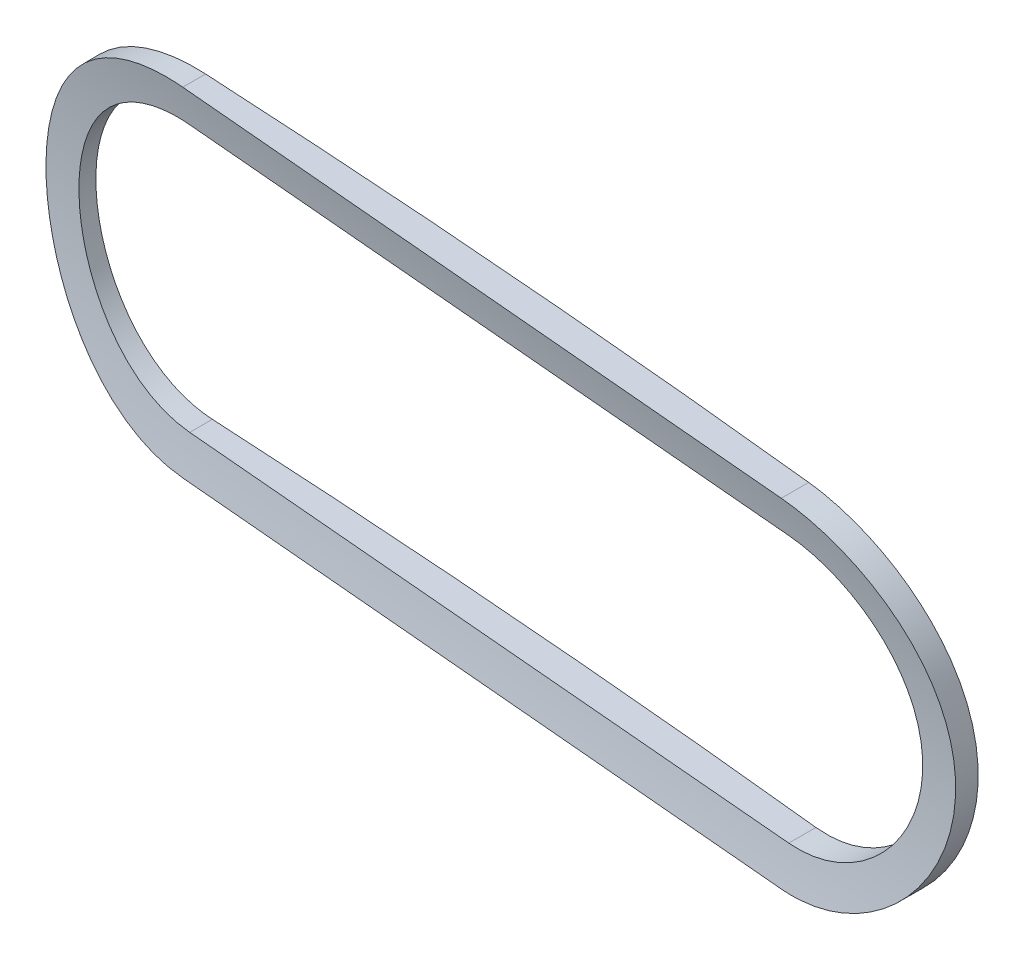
ISO-10303-21;
HEADER;
FILE_DESCRIPTION(('STEP AP214'),'2;1');
FILE_NAME('part.step','',(''),(''),'','','');
FILE_SCHEMA(('AUTOMOTIVE_DESIGN { 1 0 10303 214 1 1 1 1 }'));
ENDSEC;
DATA;
#1=APPLICATION_CONTEXT('core data for automotive mechanical design processes');
#2=APPLICATION_PROTOCOL_DEFINITION('international standard','automotive_design',2000,#1);
#3=PRODUCT_CONTEXT('',#1,'mechanical');
#4=PRODUCT('Part','Part','',(#3));
#5=PRODUCT_RELATED_PRODUCT_CATEGORY('part','',(#4));
#6=PRODUCT_DEFINITION_FORMATION('','',#4);
#7=PRODUCT_DEFINITION_CONTEXT('part definition',#1,'design');
#8=PRODUCT_DEFINITION('design','',#6,#7);
#9=PRODUCT_DEFINITION_SHAPE('','',#8);
#10=(LENGTH_UNIT() NAMED_UNIT(*) SI_UNIT(.MILLI.,.METRE.));
#11=(NAMED_UNIT(*) PLANE_ANGLE_UNIT() SI_UNIT($,.RADIAN.));
#12=(NAMED_UNIT(*) SI_UNIT($,.STERADIAN.) SOLID_ANGLE_UNIT());
#13=UNCERTAINTY_MEASURE_WITH_UNIT(LENGTH_MEASURE(1.E-05),#10,'distance_accuracy_value','');
#14=(GEOMETRIC_REPRESENTATION_CONTEXT(3) GLOBAL_UNCERTAINTY_ASSIGNED_CONTEXT((#13)) GLOBAL_UNIT_ASSIGNED_CONTEXT((#10,
#11,#12)) REPRESENTATION_CONTEXT('',''));
#15=CARTESIAN_POINT('',(0.,0.,0.));
#16=DIRECTION('',(0.,0.,1.));
#17=DIRECTION('',(1.,0.,0.));
#18=AXIS2_PLACEMENT_3D('',#15,#16,#17);
#19=CARTESIAN_POINT('',(172.24375,0.,-183.848766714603));
#20=DIRECTION('',(0.,0.,1.));
#21=DIRECTION('',(1.,0.,0.));
#22=AXIS2_PLACEMENT_3D('',#19,#20,#21);
#23=CYLINDRICAL_SURFACE('',#22,37.30625);
#24=DIRECTION('',(0.,0.,1.));
#25=VECTOR('',#24,1.);
#26=CARTESIAN_POINT('',(172.24375,-37.30625,-183.848766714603));
#27=LINE('',#26,#25);
#28=CARTESIAN_POINT('',(172.24375,-37.30625,-177.008869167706));
#29=VERTEX_POINT('',#28);
#30=CARTESIAN_POINT('',(172.24375,-37.30625,-171.968450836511));
#31=VERTEX_POINT('',#30);
#32=EDGE_CURVE('E152',#29,#31,#27,.T.);
#33=ORIENTED_EDGE('',*,*,#32,.T.);
#34=CARTESIAN_POINT('',(172.24395,-37.3062499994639,-171.968433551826));
#35=CARTESIAN_POINT('',(171.717931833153,-37.3062540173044,-172.013889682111));
#36=CARTESIAN_POINT('',(171.192184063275,-37.2951289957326,-172.061743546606));
#37=CARTESIAN_POINT('',(170.142092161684,-37.2507115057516,-172.16211018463));
#38=CARTESIAN_POINT('',(169.617747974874,-37.2174199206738,-172.21462277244));
#39=CARTESIAN_POINT('',(168.048486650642,-37.0844667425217,-172.378904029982));
#40=CARTESIAN_POINT('',(167.006902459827,-36.9517265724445,-172.497454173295));
#41=CARTESIAN_POINT('',(164.942351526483,-36.5997353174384,-172.750724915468));
#42=CARTESIAN_POINT('',(163.919355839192,-36.3806334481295,-172.885417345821));
#43=CARTESIAN_POINT('',(162.40300284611,-35.9887309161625,-173.098055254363));
#44=CARTESIAN_POINT('',(161.900543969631,-35.8475441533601,-173.170706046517));
#45=CARTESIAN_POINT('',(160.902301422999,-35.5443385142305,-173.319261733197));
#46=CARTESIAN_POINT('',(160.406519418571,-35.382314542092,-173.395167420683));
#47=CARTESIAN_POINT('',(158.931114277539,-34.8656755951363,-173.627185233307));
#48=CARTESIAN_POINT('',(157.962766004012,-34.480321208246,-173.787692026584));
#49=CARTESIAN_POINT('',(156.062923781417,-33.6306417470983,-174.117541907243));
#50=CARTESIAN_POINT('',(155.131430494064,-33.1663152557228,-174.286885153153));
#51=CARTESIAN_POINT('',(153.766327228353,-32.413138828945,-174.545201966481));
#52=CARTESIAN_POINT('',(153.316524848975,-32.1525495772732,-174.632050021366));
#53=CARTESIAN_POINT('',(152.428456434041,-31.6129771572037,-174.806755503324));
#54=CARTESIAN_POINT('',(151.99018749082,-31.333998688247,-174.894612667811));
#55=CARTESIAN_POINT('',(150.69348080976,-30.4699993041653,-175.159135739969));
#56=CARTESIAN_POINT('',(149.853076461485,-29.8578775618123,-175.336765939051));
#57=CARTESIAN_POINT('',(148.210767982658,-28.5533350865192,-175.694504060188));
#58=CARTESIAN_POINT('',(147.409900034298,-27.8596086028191,-175.874594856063));
#59=CARTESIAN_POINT('',(145.869488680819,-26.4059835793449,-176.230261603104));
#60=CARTESIAN_POINT('',(145.129946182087,-25.6460840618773,-176.405837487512));
#61=CARTESIAN_POINT('',(143.717341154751,-24.0650001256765,-176.748879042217));
#62=CARTESIAN_POINT('',(143.044284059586,-23.2438107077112,-176.916344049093));
#63=CARTESIAN_POINT('',(141.769627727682,-21.5455633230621,-177.239631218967));
#64=CARTESIAN_POINT('',(141.168027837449,-20.6685058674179,-177.395453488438));
#65=CARTESIAN_POINT('',(140.041901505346,-18.8659627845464,-177.691834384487));
#66=CARTESIAN_POINT('',(139.517240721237,-17.9405654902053,-177.832419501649));
#67=CARTESIAN_POINT('',(138.547970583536,-16.0462660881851,-178.095537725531));
#68=CARTESIAN_POINT('',(138.103361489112,-15.0773638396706,-178.218070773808));
#69=CARTESIAN_POINT('',(137.298093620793,-13.1031889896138,-178.442277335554));
#70=CARTESIAN_POINT('',(136.937415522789,-12.097924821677,-178.543955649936));
#71=CARTESIAN_POINT('',(136.303132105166,-10.0582692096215,-178.724118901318));
#72=CARTESIAN_POINT('',(136.029523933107,-9.02387872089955,-178.80260459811));
#73=CARTESIAN_POINT('',(135.579667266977,-6.9691998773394,-178.932291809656));
#74=CARTESIAN_POINT('',(135.400443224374,-5.94961474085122,-178.984325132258));
#75=CARTESIAN_POINT('',(135.127291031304,-3.89813664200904,-179.063827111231));
#76=CARTESIAN_POINT('',(135.03336096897,-2.86624395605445,-179.091296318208));
#77=CARTESIAN_POINT('',(134.931669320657,-0.797997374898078,-179.121041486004));
#78=CARTESIAN_POINT('',(134.923896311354,0.238355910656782,-179.123320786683));
#79=CARTESIAN_POINT('',(134.994562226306,2.30785924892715,-179.102642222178));
#80=CARTESIAN_POINT('',(135.073000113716,3.3410093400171,-179.079684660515));
#81=CARTESIAN_POINT('',(135.312217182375,5.36976366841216,-179.009974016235));
#82=CARTESIAN_POINT('',(135.470814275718,6.36564788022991,-178.963851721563));
#83=CARTESIAN_POINT('',(135.867744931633,8.34005227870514,-178.849153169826));
#84=CARTESIAN_POINT('',(136.106076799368,9.31857283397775,-178.78057739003));
#85=CARTESIAN_POINT('',(136.660485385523,11.2516054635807,-178.622420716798));
#86=CARTESIAN_POINT('',(136.976564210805,12.2061168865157,-178.532839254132));
#87=CARTESIAN_POINT('',(137.683915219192,14.0848008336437,-178.33453034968));
#88=CARTESIAN_POINT('',(138.075188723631,15.0089728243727,-178.225802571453));
#89=CARTESIAN_POINT('',(138.935287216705,16.8324552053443,-177.989931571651));
#90=CARTESIAN_POINT('',(139.405025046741,17.7313071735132,-177.862574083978));
#91=CARTESIAN_POINT('',(140.414974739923,19.4861560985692,-177.593069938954));
#92=CARTESIAN_POINT('',(140.955186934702,20.3421528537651,-177.45092321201));
#93=CARTESIAN_POINT('',(142.102307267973,22.0061593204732,-177.15462887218));
#94=CARTESIAN_POINT('',(142.709223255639,22.8141633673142,-177.000479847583));
#95=CARTESIAN_POINT('',(143.985596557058,24.3772688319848,-176.683160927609));
#96=CARTESIAN_POINT('',(144.65505525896,25.1323690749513,-176.519990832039));
#97=CARTESIAN_POINT('',(146.077249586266,26.6112822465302,-176.181735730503));
#98=CARTESIAN_POINT('',(146.832110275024,27.3330030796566,-176.006433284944));
#99=CARTESIAN_POINT('',(148.399266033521,28.7103679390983,-175.652894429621));
#100=CARTESIAN_POINT('',(149.211562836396,29.3660099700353,-175.474657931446));
#101=CARTESIAN_POINT('',(150.888652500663,30.6072683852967,-175.118623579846));
#102=CARTESIAN_POINT('',(151.753467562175,31.1928548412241,-174.940825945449));
#103=CARTESIAN_POINT('',(153.529693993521,32.2897806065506,-174.589126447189));
#104=CARTESIAN_POINT('',(154.441104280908,32.8011216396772,-174.415224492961));
#105=CARTESIAN_POINT('',(156.322873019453,33.7552423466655,-174.071222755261));
#106=CARTESIAN_POINT('',(157.294034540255,34.1964900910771,-173.901263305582));
#107=CARTESIAN_POINT('',(159.27228769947,34.9947881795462,-173.571939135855));
#108=CARTESIAN_POINT('',(160.2793842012,35.3518270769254,-173.412575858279));
#109=CARTESIAN_POINT('',(162.320895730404,35.9782139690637,-173.107595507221));
#110=CARTESIAN_POINT('',(163.355270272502,36.2476847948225,-172.961959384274));
#111=CARTESIAN_POINT('',(165.445068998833,36.6970761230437,-172.686731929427));
#112=CARTESIAN_POINT('',(166.500482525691,36.8770408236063,-172.55713270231));
#113=CARTESIAN_POINT('',(167.950261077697,37.0604284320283,-172.392531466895));
#114=CARTESIAN_POINT('',(168.339055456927,37.1034069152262,-172.34969390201));
#115=CARTESIAN_POINT('',(169.118001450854,37.1771290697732,-172.266503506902));
#116=CARTESIAN_POINT('',(169.508152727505,37.2078755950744,-172.226150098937));
#117=CARTESIAN_POINT('',(170.288866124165,37.2570459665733,-172.148055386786));
#118=CARTESIAN_POINT('',(170.679426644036,37.2754890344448,-172.110310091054));
#119=CARTESIAN_POINT('',(171.461268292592,37.3000945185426,-172.037410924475));
#120=CARTESIAN_POINT('',(171.852549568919,37.3062540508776,-172.002257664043));
#121=CARTESIAN_POINT('',(172.24395,37.3062499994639,-171.968433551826));
#122=B_SPLINE_CURVE_WITH_KNOTS('',3,(#34,#35,#36,#37,#38,#39,#40,#41,#42,#43,#44,#45,#46,#47,
#48,#49,#50,#51,#52,#53,#54,#55,#56,#57,#58,#59,#60,#61,#62,#63,#64,#65,#66,#67,#68,#69,#70,#71,
#72,#73,#74,#75,#76,#77,#78,#79,#80,#81,#82,#83,#84,#85,#86,#87,#88,#89,#90,#91,#92,#93,#94,#95,
#96,#97,#98,#99,#100,#101,#102,#103,#104,#105,#106,#107,#108,#109,#110,#111,#112,#113,#114,#115,
#116,#117,#118,#119,#120,#121),.UNSPECIFIED.,.F.,.F.,(4,2,2,2,2,2,2,2,2,2,2,2,2,2,2,2,2,2,2,2,2,
2,2,2,2,2,2,2,2,2,2,2,2,2,2,2,2,2,2,2,2,2,2,4),(0.,1.58368880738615,3.16731450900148,
6.33325055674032,9.49374031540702,11.0741857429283,12.6550184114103,15.8146074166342,
18.9742531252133,20.5549806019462,22.1353056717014,25.2957246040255,28.516249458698,
31.7368219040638,34.9576573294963,38.1784632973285,41.3935767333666,44.6087005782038,
47.823083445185,51.0373609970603,54.1431030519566,57.2487754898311,60.3540361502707,
63.4592594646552,66.4841713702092,69.5090189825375,72.533948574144,75.5589313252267,
78.6219310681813,81.6849452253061,84.7483202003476,87.8117631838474,90.9850296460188,
94.1583919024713,97.3331050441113,100.50774446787,103.744308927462,106.981313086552,
110.213756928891,113.44460300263,114.624968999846,115.805059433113,116.983301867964,
118.161820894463),.UNSPECIFIED.);
#123=CARTESIAN_POINT('',(172.24375,37.30625,-171.968450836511));
#124=VERTEX_POINT('',#123);
#125=EDGE_CURVE('E67',#31,#124,#122,.T.);
#126=ORIENTED_EDGE('',*,*,#125,.T.);
#127=DIRECTION('',(0.,0.,1.));
#128=VECTOR('',#127,1.);
#129=CARTESIAN_POINT('',(172.24375,37.30625,-183.848766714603));
#130=LINE('',#129,#128);
#131=CARTESIAN_POINT('',(172.24375,37.30625,-177.008869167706));
#132=VERTEX_POINT('',#131);
#133=EDGE_CURVE('E238',#132,#124,#130,.T.);
#134=ORIENTED_EDGE('',*,*,#133,.F.);
#135=CARTESIAN_POINT('',(172.24375,37.30625,-177.008869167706));
#136=CARTESIAN_POINT('',(171.545838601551,37.3062741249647,-177.0447341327));
#137=CARTESIAN_POINT('',(170.848132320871,37.2866665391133,-177.084401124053));
#138=CARTESIAN_POINT('',(169.455477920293,37.2084354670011,-177.171068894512));
#139=CARTESIAN_POINT('',(168.760529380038,37.1498181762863,-177.21806850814));
#140=CARTESIAN_POINT('',(167.375550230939,36.9938189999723,-177.319140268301));
#141=CARTESIAN_POINT('',(166.685519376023,36.8964390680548,-177.373212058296));
#142=CARTESIAN_POINT('',(165.313585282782,36.6635034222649,-177.48795910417));
#143=CARTESIAN_POINT('',(164.63167129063,36.5280059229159,-177.548624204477));
#144=CARTESIAN_POINT('',(163.276980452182,36.2192754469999,-177.676171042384));
#145=CARTESIAN_POINT('',(162.604203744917,36.046041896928,-177.743052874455));
#146=CARTESIAN_POINT('',(161.603586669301,35.7584072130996,-177.847616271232));
#147=CARTESIAN_POINT('',(161.271473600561,35.6578987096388,-177.883177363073));
#148=CARTESIAN_POINT('',(160.610249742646,35.4476848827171,-177.955647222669));
#149=CARTESIAN_POINT('',(160.281139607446,35.3379776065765,-177.992556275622));
#150=CARTESIAN_POINT('',(158.9716961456,34.881086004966,-178.142683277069));
#151=CARTESIAN_POINT('',(158.004357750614,34.4974742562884,-178.260989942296));
#152=CARTESIAN_POINT('',(156.105959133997,33.6512740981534,-178.506682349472));
#153=CARTESIAN_POINT('',(155.174904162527,33.1886743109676,-178.634069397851));
#154=CARTESIAN_POINT('',(153.810304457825,32.4381594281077,-178.829987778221));
#155=CARTESIAN_POINT('',(153.360678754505,32.1784924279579,-178.896114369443));
#156=CARTESIAN_POINT('',(152.472891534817,31.6407748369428,-179.029627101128));
#157=CARTESIAN_POINT('',(152.034726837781,31.3627294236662,-179.097012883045));
#158=CARTESIAN_POINT('',(151.170426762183,30.7886424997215,-179.232715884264));
#159=CARTESIAN_POINT('',(150.744292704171,30.4925990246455,-179.301033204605));
#160=CARTESIAN_POINT('',(149.904791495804,29.8830455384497,-179.438233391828));
#161=CARTESIAN_POINT('',(149.491425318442,29.5695342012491,-179.507116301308));
#162=CARTESIAN_POINT('',(148.260000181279,28.5944438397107,-179.716020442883));
#163=CARTESIAN_POINT('',(147.462730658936,27.9063482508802,-179.85638149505));
#164=CARTESIAN_POINT('',(145.929082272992,26.4651141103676,-180.134828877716));
#165=CARTESIAN_POINT('',(145.19270408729,25.7119748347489,-180.272915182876));
#166=CARTESIAN_POINT('',(143.785705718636,24.1454826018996,-180.543769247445));
#167=CARTESIAN_POINT('',(143.115093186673,23.3321226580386,-180.676536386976));
#168=CARTESIAN_POINT('',(141.844530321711,21.6507304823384,-180.933715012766));
#169=CARTESIAN_POINT('',(141.244579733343,20.7826984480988,-181.058126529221));
#170=CARTESIAN_POINT('',(140.118327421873,18.9955737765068,-181.296018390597));
#171=CARTESIAN_POINT('',(139.592214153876,18.0763585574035,-181.409470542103));
#172=CARTESIAN_POINT('',(138.619468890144,16.1952221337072,-181.622408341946));
#173=CARTESIAN_POINT('',(138.172837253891,15.2333007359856,-181.721893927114));
#174=CARTESIAN_POINT('',(137.362696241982,13.2737417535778,-181.904490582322));
#175=CARTESIAN_POINT('',(136.999173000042,12.2761101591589,-181.987604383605));
#176=CARTESIAN_POINT('',(136.358177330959,10.2522489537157,-182.135445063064));
#177=CARTESIAN_POINT('',(136.080703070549,9.22601995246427,-182.200172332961));
#178=CARTESIAN_POINT('',(135.619249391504,7.17515718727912,-182.308447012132));
#179=CARTESIAN_POINT('',(135.433368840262,6.15097360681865,-182.352424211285));
#180=CARTESIAN_POINT('',(135.14778769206,4.09000054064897,-182.420194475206));
#181=CARTESIAN_POINT('',(135.048085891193,3.05321123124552,-182.443987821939));
#182=CARTESIAN_POINT('',(134.935718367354,0.974750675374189,-182.470814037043));
#183=CARTESIAN_POINT('',(134.92304499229,-0.0669201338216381,-182.473848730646));
#184=CARTESIAN_POINT('',(134.984823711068,-2.14752153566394,-182.459088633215));
#185=CARTESIAN_POINT('',(135.059275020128,-3.18645215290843,-182.441294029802));
#186=CARTESIAN_POINT('',(135.292494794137,-5.23489153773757,-182.385822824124));
#187=CARTESIAN_POINT('',(135.449688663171,-6.24459013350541,-182.348517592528));
#188=CARTESIAN_POINT('',(135.846121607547,-8.24684564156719,-182.255120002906));
#189=CARTESIAN_POINT('',(136.085359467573,-9.23940280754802,-182.199027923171));
#190=CARTESIAN_POINT('',(136.643977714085,-11.2005391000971,-182.069342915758));
#191=CARTESIAN_POINT('',(136.963359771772,-12.1691177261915,-181.995749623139));
#192=CARTESIAN_POINT('',(137.67979172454,-14.0757320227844,-181.832730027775));
#193=CARTESIAN_POINT('',(138.076842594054,-15.0137673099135,-181.743303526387));
#194=CARTESIAN_POINT('',(138.949392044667,-16.8610332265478,-181.549781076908));
#195=CARTESIAN_POINT('',(139.42553804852,-17.7699454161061,-181.445565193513));
#196=CARTESIAN_POINT('',(140.450330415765,-19.5444248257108,-181.22538283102));
#197=CARTESIAN_POINT('',(140.998977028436,-20.409991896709,-181.109416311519));
#198=CARTESIAN_POINT('',(142.164948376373,-22.0922945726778,-180.86826894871));
#199=CARTESIAN_POINT('',(142.78227863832,-22.9090262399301,-180.743087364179));
#200=CARTESIAN_POINT('',(144.081382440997,-24.4884245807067,-180.486220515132));
#201=CARTESIAN_POINT('',(144.76315696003,-25.251090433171,-180.3545351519));
#202=CARTESIAN_POINT('',(146.204027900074,-26.7354620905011,-180.084193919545));
#203=CARTESIAN_POINT('',(146.964604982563,-27.4557145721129,-179.94544637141));
#204=CARTESIAN_POINT('',(148.543526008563,-28.8296882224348,-179.667098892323));
#205=CARTESIAN_POINT('',(149.361871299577,-29.4834078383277,-179.527498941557));
#206=CARTESIAN_POINT('',(151.051163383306,-30.7201357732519,-179.250415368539));
#207=CARTESIAN_POINT('',(151.922129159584,-31.3031183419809,-179.112932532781));
#208=CARTESIAN_POINT('',(153.710569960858,-32.3940527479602,-178.843068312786));
#209=CARTESIAN_POINT('',(154.628043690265,-32.9020066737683,-178.710686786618));
#210=CARTESIAN_POINT('',(156.51320217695,-33.8441738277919,-178.452446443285));
#211=CARTESIAN_POINT('',(157.481311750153,-34.2775601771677,-178.326670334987));
#212=CARTESIAN_POINT('',(159.452215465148,-35.0607678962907,-178.085757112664));
#213=CARTESIAN_POINT('',(160.455014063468,-35.4105784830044,-177.970621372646));
#214=CARTESIAN_POINT('',(162.48664630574,-36.0233206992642,-177.753471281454));
#215=CARTESIAN_POINT('',(163.515442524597,-36.2863703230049,-177.651439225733));
#216=CARTESIAN_POINT('',(165.592727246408,-36.7239122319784,-177.462267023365));
#217=CARTESIAN_POINT('',(166.641205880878,-36.8984477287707,-177.375119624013));
#218=CARTESIAN_POINT('',(168.072687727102,-37.0742927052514,-177.267897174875));
#219=CARTESIAN_POINT('',(168.450654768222,-37.1148666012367,-177.240689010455));
#220=CARTESIAN_POINT('',(169.207736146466,-37.1844498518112,-177.18841145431));
#221=CARTESIAN_POINT('',(169.58685019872,-37.21346187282,-177.1633415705));
#222=CARTESIAN_POINT('',(170.345302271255,-37.2598485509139,-177.115420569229));
#223=CARTESIAN_POINT('',(170.724638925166,-37.2772420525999,-177.09256591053));
#224=CARTESIAN_POINT('',(171.483879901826,-37.3004449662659,-177.049057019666));
#225=CARTESIAN_POINT('',(171.863784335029,-37.3062517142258,-177.028403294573));
#226=CARTESIAN_POINT('',(172.24375,-37.3062499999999,-177.008869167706));
#227=B_SPLINE_CURVE_WITH_KNOTS('',3,(#135,#136,#137,#138,#139,#140,#141,#142,#143,#144,#145,
#146,#147,#148,#149,#150,#151,#152,#153,#154,#155,#156,#157,#158,#159,#160,#161,#162,#163,#164,
#165,#166,#167,#168,#169,#170,#171,#172,#173,#174,#175,#176,#177,#178,#179,#180,#181,#182,#183,
#184,#185,#186,#187,#188,#189,#190,#191,#192,#193,#194,#195,#196,#197,#198,#199,#200,#201,#202,
#203,#204,#205,#206,#207,#208,#209,#210,#211,#212,#213,#214,#215,#216,#217,#218,#219,#220,#221,
#222,#223,#224,#225,#226),.UNSPECIFIED.,.F.,.F.,(4,2,2,2,2,2,2,2,2,2,2,2,2,2,2,2,2,2,2,2,2,2,2,
2,2,2,2,2,2,2,2,2,2,2,2,2,2,2,2,2,2,2,2,2,2,4),(0.,2.0961966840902,4.19206052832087,
6.28781875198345,8.38039347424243,10.4730000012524,11.5192950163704,12.5658126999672,
15.7037926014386,18.8422248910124,20.4120898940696,21.9815145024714,23.5511107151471,
25.1208262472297,28.3041206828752,31.4874505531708,34.6711503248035,37.8548385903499,
41.0465103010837,44.2381964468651,47.429349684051,50.6204349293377,53.7421578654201,
56.863837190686,59.9852420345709,63.1066187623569,66.1706355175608,69.2346068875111,
72.2986421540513,75.3627158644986,78.4532321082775,81.5437589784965,84.6345347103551,
87.7253573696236,90.8915896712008,94.057895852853,97.225351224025,100.392718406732,
103.593215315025,106.794124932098,109.990663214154,113.185639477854,114.328848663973,
115.471794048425,116.612881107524,117.754230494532),.UNSPECIFIED.);
#228=EDGE_CURVE('E144',#132,#29,#227,.T.);
#229=ORIENTED_EDGE('',*,*,#228,.T.);
#230=EDGE_LOOP('',(#33,#126,#134,#229));
#231=FACE_BOUND('',#230,.T.);
#232=ADVANCED_FACE('F45',(#231),#23,.T.);
#233=CARTESIAN_POINT('',(172.24375,37.30625,-183.848766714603));
#234=DIRECTION('',(0.,1.,0.));
#235=DIRECTION('',(-1.,0.,0.));
#236=AXIS2_PLACEMENT_3D('',#233,#234,#235);
#237=PLANE('',#236);
#238=ORIENTED_EDGE('',*,*,#133,.T.);
#239=CARTESIAN_POINT('',(26.1817527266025,37.30625,-184.572312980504));
#240=CARTESIAN_POINT('',(55.0227662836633,37.30625,-182.087139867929));
#241=CARTESIAN_POINT('',(83.8636142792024,37.30625,-179.600044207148));
#242=CARTESIAN_POINT('',(141.544928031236,37.30625,-174.621418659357));
#243=CARTESIAN_POINT('',(170.385393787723,37.30625,-172.129888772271));
#244=CARTESIAN_POINT('',(228.065887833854,37.30625,-167.141805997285));
#245=CARTESIAN_POINT('',(256.905916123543,37.30625,-164.645253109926));
#246=CARTESIAN_POINT('',(314.585473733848,37.30625,-159.646391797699));
#247=CARTESIAN_POINT('',(343.425003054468,37.30625,-157.144083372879));
#248=CARTESIAN_POINT('',(387.348411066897,37.30625,-153.327906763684));
#249=CARTESIAN_POINT('',(402.432499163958,37.30625,-152.01644861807));
#250=CARTESIAN_POINT('',(432.600504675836,37.30625,-149.391565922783));
#251=CARTESIAN_POINT('',(447.684422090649,37.30625,-148.078141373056));
#252=CARTESIAN_POINT('',(462.768247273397,37.30625,-146.763658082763));
#253=B_SPLINE_CURVE_WITH_KNOTS('',3,(#239,#240,#241,#242,#243,#244,#245,#246,#247,#248,#249,
#250,#251,#252),.UNSPECIFIED.,.F.,.F.,(4,2,2,2,2,2,4),(0.,86.8436603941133,173.687322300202,
260.530974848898,347.374626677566,392.797602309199,438.220579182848),.UNSPECIFIED.);
#254=CARTESIAN_POINT('',(316.706249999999,37.30625,-159.461456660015));
#255=VERTEX_POINT('',#254);
#256=EDGE_CURVE('E176',#124,#255,#253,.T.);
#257=ORIENTED_EDGE('',*,*,#256,.T.);
#258=DIRECTION('',(0.,0.,1.));
#259=VECTOR('',#258,1.);
#260=CARTESIAN_POINT('',(316.706249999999,37.30625,-183.848766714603));
#261=LINE('',#260,#259);
#262=CARTESIAN_POINT('',(316.706249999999,37.30625,-165.50908757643));
#263=VERTEX_POINT('',#262);
#264=EDGE_CURVE('E237',#263,#255,#261,.T.);
#265=ORIENTED_EDGE('',*,*,#264,.F.);
#266=CARTESIAN_POINT('',(316.706249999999,37.30625,-165.50908757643));
#267=CARTESIAN_POINT('',(314.704100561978,37.30625,-165.72150363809));
#268=CARTESIAN_POINT('',(312.701780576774,37.30625,-165.932318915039));
#269=CARTESIAN_POINT('',(308.696765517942,37.30625,-166.350378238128));
#270=CARTESIAN_POINT('',(306.694070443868,37.30625,-166.55762228));
#271=CARTESIAN_POINT('',(302.688470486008,37.30625,-166.968149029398));
#272=CARTESIAN_POINT('',(300.685565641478,37.30625,-167.171432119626));
#273=CARTESIAN_POINT('',(296.679321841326,37.30625,-167.57366944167));
#274=CARTESIAN_POINT('',(294.675982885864,37.30625,-167.772623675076));
#275=CARTESIAN_POINT('',(290.669010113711,37.30625,-168.165820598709));
#276=CARTESIAN_POINT('',(288.665376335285,37.30625,-168.360063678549));
#277=CARTESIAN_POINT('',(284.657618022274,37.30625,-168.743420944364));
#278=CARTESIAN_POINT('',(282.653493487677,37.30625,-168.932535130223));
#279=CARTESIAN_POINT('',(278.644906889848,37.30625,-169.305808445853));
#280=CARTESIAN_POINT('',(276.640444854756,37.30625,-169.489967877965));
#281=CARTESIAN_POINT('',(272.631099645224,37.30625,-169.853641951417));
#282=CARTESIAN_POINT('',(270.62621647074,37.30625,-170.033156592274));
#283=CARTESIAN_POINT('',(264.611154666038,37.30625,-170.56514285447));
#284=CARTESIAN_POINT('',(260.600396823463,37.30625,-170.91107231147));
#285=CARTESIAN_POINT('',(252.577688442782,37.30625,-171.587557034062));
#286=CARTESIAN_POINT('',(248.56573793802,37.30625,-171.918112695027));
#287=CARTESIAN_POINT('',(242.546724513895,37.30625,-172.400651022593));
#288=CARTESIAN_POINT('',(240.540194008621,37.30625,-172.559282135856));
#289=CARTESIAN_POINT('',(236.526767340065,37.30625,-172.871851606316));
#290=CARTESIAN_POINT('',(234.519871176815,37.30625,-173.025789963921));
#291=CARTESIAN_POINT('',(230.505669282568,37.30625,-173.328656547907));
#292=CARTESIAN_POINT('',(228.498363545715,37.30625,-173.477584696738));
#293=CARTESIAN_POINT('',(224.483378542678,37.30625,-173.770310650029));
#294=CARTESIAN_POINT('',(222.475699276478,37.30625,-173.914108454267));
#295=CARTESIAN_POINT('',(216.451989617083,37.30625,-174.33821978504));
#296=CARTESIAN_POINT('',(212.435443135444,37.30625,-174.611239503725));
#297=CARTESIAN_POINT('',(206.409627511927,37.30625,-175.007420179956));
#298=CARTESIAN_POINT('',(204.400793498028,37.30625,-175.137259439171));
#299=CARTESIAN_POINT('',(200.382858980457,37.30625,-175.392760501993));
#300=CARTESIAN_POINT('',(198.373758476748,37.30625,-175.518422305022));
#301=CARTESIAN_POINT('',(194.355128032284,37.30625,-175.765441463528));
#302=CARTESIAN_POINT('',(192.345598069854,37.30625,-175.886798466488));
#303=CARTESIAN_POINT('',(188.32626021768,37.30625,-176.124808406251));
#304=CARTESIAN_POINT('',(186.316452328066,37.30625,-176.241461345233));
#305=CARTESIAN_POINT('',(182.296334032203,37.30625,-176.469743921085));
#306=CARTESIAN_POINT('',(180.286023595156,37.30625,-176.58137301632));
#307=CARTESIAN_POINT('',(176.265108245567,37.30625,-176.799246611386));
#308=CARTESIAN_POINT('',(174.254503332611,37.30625,-176.905491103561));
#309=CARTESIAN_POINT('',(172.24375,37.3062499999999,-177.008869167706));
#310=B_SPLINE_CURVE_WITH_KNOTS('',3,(#266,#267,#268,#269,#270,#271,#272,#273,#274,#275,#276,
#277,#278,#279,#280,#281,#282,#283,#284,#285,#286,#287,#288,#289,#290,#291,#292,#293,#294,#295,
#296,#297,#298,#299,#300,#301,#302,#303,#304,#305,#306,#307,#308,#309),.UNSPECIFIED.,.F.,.F.,(4,
2,2,2,2,2,2,2,2,2,2,2,2,2,2,2,2,2,2,2,2,4),(0.,6.04015823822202,12.0803236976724,
18.1199026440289,24.159479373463,30.1985549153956,36.2376305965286,42.2763369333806,
48.315043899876,60.3919548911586,72.4685551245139,78.5069239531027,84.5452922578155,
90.583753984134,96.6222159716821,108.699608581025,114.738682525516,120.777757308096,
126.817325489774,132.856890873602,138.897105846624,144.937329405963),.UNSPECIFIED.);
#311=EDGE_CURVE('E153',#263,#132,#310,.T.);
#312=ORIENTED_EDGE('',*,*,#311,.T.);
#313=EDGE_LOOP('',(#238,#257,#265,#312));
#314=FACE_BOUND('',#313,.T.);
#315=ADVANCED_FACE('F162',(#314),#237,.T.);
#316=CARTESIAN_POINT('',(316.706249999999,0.,-183.848766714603));
#317=DIRECTION('',(0.,0.,1.));
#318=DIRECTION('',(1.,0.,0.));
#319=AXIS2_PLACEMENT_3D('',#316,#317,#318);
#320=CYLINDRICAL_SURFACE('',#319,37.30625);
#321=ORIENTED_EDGE('',*,*,#264,.T.);
#322=CARTESIAN_POINT('',(316.706049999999,37.3062499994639,-159.461474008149));
#323=CARTESIAN_POINT('',(317.217938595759,37.3062539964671,-159.417068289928));
#324=CARTESIAN_POINT('',(317.729984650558,37.2957184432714,-159.375121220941));
#325=CARTESIAN_POINT('',(318.753582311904,37.2535518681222,-159.296200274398));
#326=CARTESIAN_POINT('',(319.265133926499,37.2219211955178,-159.259226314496));
#327=CARTESIAN_POINT('',(320.797587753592,37.0953837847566,-159.155864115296));
#328=CARTESIAN_POINT('',(321.816561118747,36.9688316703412,-159.097011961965));
#329=CARTESIAN_POINT('',(323.840115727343,36.6321553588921,-158.999487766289));
#330=CARTESIAN_POINT('',(324.844715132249,36.422148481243,-158.960787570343));
#331=CARTESIAN_POINT('',(326.336180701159,36.0455804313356,-158.917297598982));
#332=CARTESIAN_POINT('',(326.830782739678,35.9097915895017,-158.905227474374));
#333=CARTESIAN_POINT('',(327.814178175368,35.6178796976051,-158.885795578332));
#334=CARTESIAN_POINT('',(328.302970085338,35.4617515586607,-158.878434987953));
#335=CARTESIAN_POINT('',(329.759377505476,34.9631954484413,-158.863191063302));
#336=CARTESIAN_POINT('',(330.716923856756,34.5906212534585,-158.862148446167));
#337=CARTESIAN_POINT('',(332.597921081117,33.7678085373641,-158.876663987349));
#338=CARTESIAN_POINT('',(333.521371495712,33.3175689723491,-158.892222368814));
#339=CARTESIAN_POINT('',(334.875985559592,32.5865094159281,-158.926424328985));
#340=CARTESIAN_POINT('',(335.322497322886,32.3334956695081,-158.939638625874));
#341=CARTESIAN_POINT('',(336.204535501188,31.8093725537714,-158.969390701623));
#342=CARTESIAN_POINT('',(336.640064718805,31.5382678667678,-158.98592762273));
#343=CARTESIAN_POINT('',(337.499526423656,30.9783635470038,-159.022019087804));
#344=CARTESIAN_POINT('',(337.92345781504,30.6895622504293,-159.041573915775));
#345=CARTESIAN_POINT('',(338.758972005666,30.0947970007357,-159.08337262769));
#346=CARTESIAN_POINT('',(339.170553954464,29.788831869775,-159.1056166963));
#347=CARTESIAN_POINT('',(340.39161626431,28.8413907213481,-159.176220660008));
#348=CARTESIAN_POINT('',(341.181298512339,28.1743511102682,-159.228187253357));
#349=CARTESIAN_POINT('',(342.702259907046,26.7774224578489,-159.338795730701));
#350=CARTESIAN_POINT('',(343.433538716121,26.0475330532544,-159.39743765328));
#351=CARTESIAN_POINT('',(344.833101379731,24.5296205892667,-159.518480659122));
#352=CARTESIAN_POINT('',(345.501371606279,23.7415850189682,-159.580882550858));
#353=CARTESIAN_POINT('',(346.770237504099,22.1128633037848,-159.706523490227));
#354=CARTESIAN_POINT('',(347.370832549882,21.2721766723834,-159.76976254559));
#355=CARTESIAN_POINT('',(348.509393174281,19.5298903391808,-159.895280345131));
#356=CARTESIAN_POINT('',(349.04619717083,18.6275288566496,-159.957527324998));
#357=CARTESIAN_POINT('',(350.041981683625,16.7805262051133,-160.077258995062));
#358=CARTESIAN_POINT('',(350.50096132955,15.8358845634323,-160.134743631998));
#359=CARTESIAN_POINT('',(351.337759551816,13.911005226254,-160.242487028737));
#360=CARTESIAN_POINT('',(351.715585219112,12.9307706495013,-160.29274641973));
#361=CARTESIAN_POINT('',(352.387350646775,10.9415445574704,-160.383936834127));
#362=CARTESIAN_POINT('',(352.681290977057,9.932553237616,-160.424867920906));
#363=CARTESIAN_POINT('',(353.182531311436,7.89526380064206,-160.495629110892));
#364=CARTESIAN_POINT('',(353.3900219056,6.867013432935,-160.525483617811));
#365=CARTESIAN_POINT('',(353.717726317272,4.79641426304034,-160.572998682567));
#366=CARTESIAN_POINT('',(353.83794015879,3.75406546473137,-160.590659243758));
#367=CARTESIAN_POINT('',(353.990165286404,1.66283609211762,-160.613067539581));
#368=CARTESIAN_POINT('',(354.022178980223,0.613955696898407,-160.617815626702));
#369=CARTESIAN_POINT('',(353.997762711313,-1.48274824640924,-160.614207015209));
#370=CARTESIAN_POINT('',(353.94133331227,-2.53057180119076,-160.605850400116));
#371=CARTESIAN_POINT('',(353.741405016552,-4.60784185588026,-160.576509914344));
#372=CARTESIAN_POINT('',(353.598721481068,-5.63736862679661,-160.555644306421));
#373=CARTESIAN_POINT('',(353.228055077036,-7.68063248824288,-160.502219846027));
#374=CARTESIAN_POINT('',(353.000072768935,-8.69436968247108,-160.469661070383));
#375=CARTESIAN_POINT('',(352.460493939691,-10.6989600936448,-160.394158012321));
#376=CARTESIAN_POINT('',(352.148895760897,-11.6898128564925,-160.351213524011));
#377=CARTESIAN_POINT('',(351.444354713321,-13.641737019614,-160.256681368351));
#378=CARTESIAN_POINT('',(351.051411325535,-14.6028082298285,-160.205093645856));
#379=CARTESIAN_POINT('',(350.18529395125,-16.4922452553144,-160.095183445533));
#380=CARTESIAN_POINT('',(349.71181275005,-17.4204687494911,-160.036835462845));
#381=CARTESIAN_POINT('',(348.689027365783,-19.2338734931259,-159.91603855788));
#382=CARTESIAN_POINT('',(348.139723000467,-20.1190546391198,-159.853589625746));
#383=CARTESIAN_POINT('',(346.969060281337,-21.8403755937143,-159.727311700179));
#384=CARTESIAN_POINT('',(346.34769826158,-22.6765129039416,-159.663482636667));
#385=CARTESIAN_POINT('',(345.03718543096,-24.2939872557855,-159.53734890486));
#386=CARTESIAN_POINT('',(344.348034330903,-25.0753240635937,-159.475044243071));
#387=CARTESIAN_POINT('',(342.90015011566,-26.5845667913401,-159.354417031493));
#388=CARTESIAN_POINT('',(342.140848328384,-27.3119306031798,-159.296135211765));
#389=CARTESIAN_POINT('',(340.563243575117,-28.7002477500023,-159.187259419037));
#390=CARTESIAN_POINT('',(339.744939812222,-29.3612001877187,-159.136665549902));
#391=CARTESIAN_POINT('',(338.054920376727,-30.6120222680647,-159.046155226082));
#392=CARTESIAN_POINT('',(337.183195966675,-31.2018802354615,-159.006240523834));
#393=CARTESIAN_POINT('',(335.392678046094,-32.306034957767,-158.939906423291));
#394=CARTESIAN_POINT('',(334.473886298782,-32.8203345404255,-158.913486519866));
#395=CARTESIAN_POINT('',(332.602851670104,-33.7660326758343,-158.876783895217));
#396=CARTESIAN_POINT('',(331.650908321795,-34.1980192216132,-158.866382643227));
#397=CARTESIAN_POINT('',(329.713983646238,-34.9806548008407,-158.863406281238));
#398=CARTESIAN_POINT('',(328.728998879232,-35.331295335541,-158.870833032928));
#399=CARTESIAN_POINT('',(326.734552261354,-35.9482690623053,-158.905076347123));
#400=CARTESIAN_POINT('',(325.725119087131,-36.2146963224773,-158.93187116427));
#401=CARTESIAN_POINT('',(323.688464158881,-36.6618464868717,-159.005854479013));
#402=CARTESIAN_POINT('',(322.661250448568,-36.842607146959,-159.053033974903));
#403=CARTESIAN_POINT('',(321.220450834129,-37.0344237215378,-159.133381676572));
#404=CARTESIAN_POINT('',(320.81095712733,-37.0820385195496,-159.15780227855));
#405=CARTESIAN_POINT('',(319.990892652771,-37.1636527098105,-159.20989040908));
#406=CARTESIAN_POINT('',(319.580322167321,-37.197655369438,-159.237557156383));
#407=CARTESIAN_POINT('',(318.759257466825,-37.2519856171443,-159.296074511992));
#408=CARTESIAN_POINT('',(318.348764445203,-37.2723377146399,-159.326919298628));
#409=CARTESIAN_POINT('',(317.527486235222,-37.2994739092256,-159.39180721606));
#410=CARTESIAN_POINT('',(317.116701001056,-37.3062548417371,-159.425851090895));
#411=CARTESIAN_POINT('',(316.70605,-37.3062499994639,-159.461474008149));
#412=B_SPLINE_CURVE_WITH_KNOTS('',3,(#322,#323,#324,#325,#326,#327,#328,#329,#330,#331,#332,
#333,#334,#335,#336,#337,#338,#339,#340,#341,#342,#343,#344,#345,#346,#347,#348,#349,#350,#351,
#352,#353,#354,#355,#356,#357,#358,#359,#360,#361,#362,#363,#364,#365,#366,#367,#368,#369,#370,
#371,#372,#373,#374,#375,#376,#377,#378,#379,#380,#381,#382,#383,#384,#385,#386,#387,#388,#389,
#390,#391,#392,#393,#394,#395,#396,#397,#398,#399,#400,#401,#402,#403,#404,#405,#406,#407,#408,
#409,#410,#411),.UNSPECIFIED.,.F.,.F.,(4,2,2,2,2,2,2,2,2,2,2,2,2,2,2,2,2,2,2,2,2,2,2,2,2,2,2,2,
2,2,2,2,2,2,2,2,2,2,2,2,2,2,2,2,4),(0.,1.54120696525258,3.08238840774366,6.16393439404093,
9.2411636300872,10.7798990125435,12.319020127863,15.3975735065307,18.4761682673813,
20.0159465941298,21.555327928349,23.0948542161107,24.6344862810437,27.7355878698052,
30.8367073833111,33.9384960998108,37.0403134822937,40.1919780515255,43.3436778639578,
46.4951021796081,49.646505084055,52.7909230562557,55.9353401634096,59.0796714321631,
62.2239826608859,65.3390255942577,68.4540480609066,71.5691322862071,74.6842363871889,
77.8115011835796,80.9387734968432,84.0662049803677,87.193649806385,90.3491462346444,
93.5046852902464,96.6607418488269,99.8166802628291,102.949152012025,106.081950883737,
109.211237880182,112.339144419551,113.577898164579,114.81635438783,116.05258098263,
117.289095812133),.UNSPECIFIED.);
#413=CARTESIAN_POINT('',(316.706249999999,-37.30625,-159.461456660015));
#414=VERTEX_POINT('',#413);
#415=EDGE_CURVE('E219',#255,#414,#412,.T.);
#416=ORIENTED_EDGE('',*,*,#415,.T.);
#417=DIRECTION('',(0.,0.,1.));
#418=VECTOR('',#417,1.);
#419=CARTESIAN_POINT('',(316.706249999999,-37.30625,-183.848766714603));
#420=LINE('',#419,#418);
#421=CARTESIAN_POINT('',(316.706249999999,-37.30625,-165.50908757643));
#422=VERTEX_POINT('',#421);
#423=EDGE_CURVE('E245',#422,#414,#420,.T.);
#424=ORIENTED_EDGE('',*,*,#423,.F.);
#425=CARTESIAN_POINT('',(316.706249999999,-37.30625,-165.50908757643));
#426=CARTESIAN_POINT('',(317.390102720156,-37.3062739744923,-165.436501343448));
#427=CARTESIAN_POINT('',(318.074387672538,-37.2874474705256,-165.367941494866));
#428=CARTESIAN_POINT('',(319.441644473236,-37.2121242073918,-165.239023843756));
#429=CARTESIAN_POINT('',(320.124616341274,-37.1556280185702,-165.178665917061));
#430=CARTESIAN_POINT('',(321.487082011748,-37.004996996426,-165.066299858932));
#431=CARTESIAN_POINT('',(322.166575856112,-36.9108626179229,-165.01429162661));
#432=CARTESIAN_POINT('',(323.519139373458,-36.6852877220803,-164.918693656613));
#433=CARTESIAN_POINT('',(324.192215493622,-36.553889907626,-164.875094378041));
#434=CARTESIAN_POINT('',(325.53054838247,-36.2540797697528,-164.796158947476));
#435=CARTESIAN_POINT('',(326.195805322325,-36.0856682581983,-164.760822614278));
#436=CARTESIAN_POINT('',(327.516360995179,-35.712303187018,-164.698225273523));
#437=CARTESIAN_POINT('',(328.171659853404,-35.5073500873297,-164.670964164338));
#438=CARTESIAN_POINT('',(329.470579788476,-35.0613743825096,-164.624218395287));
#439=CARTESIAN_POINT('',(330.11419377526,-34.8203306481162,-164.604738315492));
#440=CARTESIAN_POINT('',(331.38729552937,-34.3029927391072,-164.573199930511));
#441=CARTESIAN_POINT('',(332.016782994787,-34.0266978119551,-164.561141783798));
#442=CARTESIAN_POINT('',(333.25961099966,-33.4397191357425,-164.543986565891));
#443=CARTESIAN_POINT('',(333.872951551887,-33.1290354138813,-164.538889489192));
#444=CARTESIAN_POINT('',(335.081470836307,-32.4742946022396,-164.535120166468));
#445=CARTESIAN_POINT('',(335.676651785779,-32.1302416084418,-164.536447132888));
#446=CARTESIAN_POINT('',(336.84707608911,-31.4098009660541,-164.544923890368));
#447=CARTESIAN_POINT('',(337.422319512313,-31.0334134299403,-164.552073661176));
#448=CARTESIAN_POINT('',(338.55105006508,-30.2495167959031,-164.571539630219));
#449=CARTESIAN_POINT('',(339.104537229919,-29.8420077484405,-164.583855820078));
#450=CARTESIAN_POINT('',(340.461590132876,-28.7838202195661,-164.620309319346));
#451=CARTESIAN_POINT('',(341.250426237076,-28.1141932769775,-164.647275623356));
#452=CARTESIAN_POINT('',(342.769541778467,-26.7119805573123,-164.708837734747));
#453=CARTESIAN_POINT('',(343.4998210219,-25.979394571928,-164.743433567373));
#454=CARTESIAN_POINT('',(344.897101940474,-24.4560928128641,-164.81770503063));
#455=CARTESIAN_POINT('',(345.56408977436,-23.6653643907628,-164.857381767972));
#456=CARTESIAN_POINT('',(346.830061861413,-22.0313524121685,-164.939256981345));
#457=CARTESIAN_POINT('',(347.429045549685,-21.1880684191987,-164.98145547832));
#458=CARTESIAN_POINT('',(348.562343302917,-19.4432988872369,-165.066459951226));
#459=CARTESIAN_POINT('',(349.095705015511,-18.541194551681,-165.109266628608));
#460=CARTESIAN_POINT('',(350.084714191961,-16.6952348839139,-165.192533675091));
#461=CARTESIAN_POINT('',(350.540360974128,-15.751379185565,-165.232994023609));
#462=CARTESIAN_POINT('',(351.370678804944,-13.8286006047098,-165.309406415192));
#463=CARTESIAN_POINT('',(351.745355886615,-12.8496803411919,-165.345358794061));
#464=CARTESIAN_POINT('',(352.411087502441,-10.8635992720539,-165.410907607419));
#465=CARTESIAN_POINT('',(352.702142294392,-9.8564385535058,-165.440504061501));
#466=CARTESIAN_POINT('',(353.19878318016,-7.81991089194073,-165.491882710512));
#467=CARTESIAN_POINT('',(353.4042769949,-6.79052122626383,-165.513656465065));
#468=CARTESIAN_POINT('',(353.727830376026,-4.71793850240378,-165.548267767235));
#469=CARTESIAN_POINT('',(353.84588980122,-3.67474542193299,-165.561105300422));
#470=CARTESIAN_POINT('',(353.993696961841,-1.58205134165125,-165.577215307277));
#471=CARTESIAN_POINT('',(354.023445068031,-0.532550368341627,-165.580487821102));
#472=CARTESIAN_POINT('',(353.994408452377,1.56520827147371,-165.577308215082));
#473=CARTESIAN_POINT('',(353.935624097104,2.61346594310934,-165.570856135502));
#474=CARTESIAN_POINT('',(353.73052136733,4.69552330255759,-165.54860331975));
#475=CARTESIAN_POINT('',(353.584680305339,5.72937059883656,-165.532853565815));
#476=CARTESIAN_POINT('',(353.206929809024,7.78104594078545,-165.492812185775));
#477=CARTESIAN_POINT('',(352.975020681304,8.79887404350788,-165.468520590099));
#478=CARTESIAN_POINT('',(352.426813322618,10.8113515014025,-165.412589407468));
#479=CARTESIAN_POINT('',(352.11051368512,11.806000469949,-165.380949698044));
#480=CARTESIAN_POINT('',(351.395795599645,13.7651367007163,-165.311908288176));
#481=CARTESIAN_POINT('',(350.997376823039,14.7296238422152,-165.274506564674));
#482=CARTESIAN_POINT('',(350.120144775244,16.6240874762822,-165.195770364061));
#483=CARTESIAN_POINT('',(349.64113274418,17.553971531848,-165.154426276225));
#484=CARTESIAN_POINT('',(348.606782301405,19.3701955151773,-165.070112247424));
#485=CARTESIAN_POINT('',(348.051443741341,20.2565353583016,-165.027142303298));
#486=CARTESIAN_POINT('',(346.868299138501,21.979518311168,-164.942021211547));
#487=CARTESIAN_POINT('',(346.240491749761,22.8161604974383,-164.899870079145));
#488=CARTESIAN_POINT('',(344.916771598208,24.4338920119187,-164.818976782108));
#489=CARTESIAN_POINT('',(344.22085879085,25.2149813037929,-164.780234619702));
#490=CARTESIAN_POINT('',(342.762693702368,26.7192801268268,-164.708657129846));
#491=CARTESIAN_POINT('',(342.000174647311,27.4422323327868,-164.675847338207));
#492=CARTESIAN_POINT('',(340.416678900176,28.8214192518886,-164.619007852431));
#493=CARTESIAN_POINT('',(339.595701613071,29.4776532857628,-164.594978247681));
#494=CARTESIAN_POINT('',(337.901031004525,30.7187385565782,-164.558270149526));
#495=CARTESIAN_POINT('',(337.027329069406,31.3035780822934,-164.545593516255));
#496=CARTESIAN_POINT('',(335.233555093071,32.3975067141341,-164.533974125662));
#497=CARTESIAN_POINT('',(334.313484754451,32.9065985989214,-164.535030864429));
#498=CARTESIAN_POINT('',(332.752364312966,33.6862193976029,-164.549902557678));
#499=CARTESIAN_POINT('',(332.122343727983,33.9791522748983,-164.559275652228));
#500=CARTESIAN_POINT('',(330.84700357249,34.5293722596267,-164.585430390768));
#501=CARTESIAN_POINT('',(330.201683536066,34.7866582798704,-164.602212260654));
#502=CARTESIAN_POINT('',(328.897849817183,35.2647619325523,-164.643611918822));
#503=CARTESIAN_POINT('',(328.239334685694,35.4855755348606,-164.668230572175));
#504=CARTESIAN_POINT('',(326.912073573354,35.8898055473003,-164.725601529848));
#505=CARTESIAN_POINT('',(326.243339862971,36.0732635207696,-164.758344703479));
#506=CARTESIAN_POINT('',(324.897218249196,36.402533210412,-164.832202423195));
#507=CARTESIAN_POINT('',(324.219831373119,36.5483493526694,-164.873315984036));
#508=CARTESIAN_POINT('',(322.858826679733,36.8019149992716,-164.964023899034));
#509=CARTESIAN_POINT('',(322.17521193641,36.9096823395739,-165.013614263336));
#510=CARTESIAN_POINT('',(321.092207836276,37.0496994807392,-165.098646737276));
#511=CARTESIAN_POINT('',(320.694192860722,37.094648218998,-165.131268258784));
#512=CARTESIAN_POINT('',(319.897244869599,37.1716833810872,-165.199343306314));
#513=CARTESIAN_POINT('',(319.498312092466,37.2037728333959,-165.234796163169));
#514=CARTESIAN_POINT('',(318.700613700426,37.2550431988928,-165.30844707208));
#515=CARTESIAN_POINT('',(318.301849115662,37.2742476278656,-165.346639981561));
#516=CARTESIAN_POINT('',(317.504091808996,37.2998537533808,-165.425796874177));
#517=CARTESIAN_POINT('',(317.105099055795,37.3062525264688,-165.46676148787));
#518=CARTESIAN_POINT('',(316.706249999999,37.3062499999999,-165.50908757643));
#519=B_SPLINE_CURVE_WITH_KNOTS('',3,(#425,#426,#427,#428,#429,#430,#431,#432,#433,#434,#435,
#436,#437,#438,#439,#440,#441,#442,#443,#444,#445,#446,#447,#448,#449,#450,#451,#452,#453,#454,
#455,#456,#457,#458,#459,#460,#461,#462,#463,#464,#465,#466,#467,#468,#469,#470,#471,#472,#473,
#474,#475,#476,#477,#478,#479,#480,#481,#482,#483,#484,#485,#486,#487,#488,#489,#490,#491,#492,
#493,#494,#495,#496,#497,#498,#499,#500,#501,#502,#503,#504,#505,#506,#507,#508,#509,#510,#511,
#512,#513,#514,#515,#516,#517,#518),.UNSPECIFIED.,.F.,.F.,(4,2,2,2,2,2,2,2,2,2,2,2,2,2,2,2,2,2,
2,2,2,2,2,2,2,2,2,2,2,2,2,2,2,2,2,2,2,2,2,2,2,2,2,2,2,2,4),(0.,2.06282017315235,
4.12560911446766,6.18837312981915,8.24878276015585,10.3091472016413,12.3694857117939,
14.4310351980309,16.4926287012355,18.5542205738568,20.6155597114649,22.6768916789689,
24.7382203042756,27.83962678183,30.9410435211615,34.0431369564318,37.145256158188,
40.2881053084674,43.4309820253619,46.573624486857,49.7162572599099,52.8622706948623,
56.0082892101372,59.1542945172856,62.3002867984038,65.4291867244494,68.5580755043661,
71.6870164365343,74.8159698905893,77.9527562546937,81.0895487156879,84.2263994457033,
87.3632522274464,90.5133017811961,93.6633834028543,96.8139810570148,99.9644631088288,
102.048011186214,104.131622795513,106.215464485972,108.296974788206,110.378240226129,
112.45852873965,113.663954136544,114.86909547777,116.072031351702,117.275241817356),.UNSPECIFIED.);
#520=EDGE_CURVE('E230',#422,#263,#519,.T.);
#521=ORIENTED_EDGE('',*,*,#520,.T.);
#522=EDGE_LOOP('',(#321,#416,#424,#521));
#523=FACE_BOUND('',#522,.T.);
#524=ADVANCED_FACE('F225',(#523),#320,.T.);
#525=CARTESIAN_POINT('',(172.24375,-37.30625,-183.848766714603));
#526=DIRECTION('',(0.,-1.,0.));
#527=DIRECTION('',(0.,0.,-1.));
#528=AXIS2_PLACEMENT_3D('',#525,#526,#527);
#529=PLANE('',#528);
#530=ORIENTED_EDGE('',*,*,#423,.T.);
#531=CARTESIAN_POINT('',(462.768247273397,-37.30625,-146.763658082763));
#532=CARTESIAN_POINT('',(439.5768311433,-37.30625,-148.784667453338));
#533=CARTESIAN_POINT('',(416.385198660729,-37.30625,-150.803192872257));
#534=CARTESIAN_POINT('',(370.001545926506,-37.30625,-154.835781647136));
#535=CARTESIAN_POINT('',(346.809525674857,-37.30625,-156.849845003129));
#536=CARTESIAN_POINT('',(300.42514356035,-37.30625,-160.874015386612));
#537=CARTESIAN_POINT('',(277.232781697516,-37.30625,-162.884122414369));
#538=CARTESIAN_POINT('',(230.847751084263,-37.30625,-166.900792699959));
#539=CARTESIAN_POINT('',(207.655082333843,-37.30625,-168.907355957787));
#540=CARTESIAN_POINT('',(158.082519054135,-37.30625,-173.192810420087));
#541=CARTESIAN_POINT('',(131.70258418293,-37.30625,-175.471234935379));
#542=CARTESIAN_POINT('',(78.9423967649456,-37.30625,-180.02441506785));
#543=CARTESIAN_POINT('',(52.5621442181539,-37.30625,-182.299170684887));
#544=CARTESIAN_POINT('',(26.1817527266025,-37.30625,-184.572312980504));
#545=B_SPLINE_CURVE_WITH_KNOTS('',3,(#531,#532,#533,#534,#535,#536,#537,#538,#539,#540,#541,
#542,#543,#544),.UNSPECIFIED.,.F.,.F.,(4,2,2,2,2,2,4),(0.,69.8379288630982,139.675857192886,
209.513780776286,279.351704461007,358.786140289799,438.220579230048),.UNSPECIFIED.);
#546=EDGE_CURVE('E130',#414,#31,#545,.T.);
#547=ORIENTED_EDGE('',*,*,#546,.T.);
#548=ORIENTED_EDGE('',*,*,#32,.F.);
#549=CARTESIAN_POINT('',(172.24375,-37.30625,-177.008869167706));
#550=CARTESIAN_POINT('',(174.254503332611,-37.30625,-176.905491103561));
#551=CARTESIAN_POINT('',(176.265108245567,-37.30625,-176.799246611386));
#552=CARTESIAN_POINT('',(180.286023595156,-37.30625,-176.58137301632));
#553=CARTESIAN_POINT('',(182.296334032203,-37.30625,-176.469743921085));
#554=CARTESIAN_POINT('',(186.316452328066,-37.30625,-176.241461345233));
#555=CARTESIAN_POINT('',(188.32626021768,-37.30625,-176.124808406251));
#556=CARTESIAN_POINT('',(192.345598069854,-37.30625,-175.886798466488));
#557=CARTESIAN_POINT('',(194.355128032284,-37.30625,-175.765441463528));
#558=CARTESIAN_POINT('',(198.373758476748,-37.30625,-175.518422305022));
#559=CARTESIAN_POINT('',(200.382858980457,-37.30625,-175.392760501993));
#560=CARTESIAN_POINT('',(204.400793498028,-37.30625,-175.137259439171));
#561=CARTESIAN_POINT('',(206.409627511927,-37.30625,-175.007420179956));
#562=CARTESIAN_POINT('',(212.435443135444,-37.30625,-174.611239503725));
#563=CARTESIAN_POINT('',(216.451989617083,-37.30625,-174.33821978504));
#564=CARTESIAN_POINT('',(222.475699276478,-37.30625,-173.914108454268));
#565=CARTESIAN_POINT('',(224.483378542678,-37.30625,-173.770310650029));
#566=CARTESIAN_POINT('',(228.498363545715,-37.30625,-173.477584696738));
#567=CARTESIAN_POINT('',(230.505669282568,-37.30625,-173.328656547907));
#568=CARTESIAN_POINT('',(234.519871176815,-37.30625,-173.025789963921));
#569=CARTESIAN_POINT('',(236.526767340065,-37.30625,-172.871851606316));
#570=CARTESIAN_POINT('',(240.540194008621,-37.30625,-172.559282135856));
#571=CARTESIAN_POINT('',(242.546724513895,-37.30625,-172.400651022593));
#572=CARTESIAN_POINT('',(248.56573793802,-37.30625,-171.918112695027));
#573=CARTESIAN_POINT('',(252.577688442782,-37.30625,-171.587557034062));
#574=CARTESIAN_POINT('',(260.600396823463,-37.30625,-170.91107231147));
#575=CARTESIAN_POINT('',(264.611154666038,-37.30625,-170.56514285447));
#576=CARTESIAN_POINT('',(270.62621647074,-37.30625,-170.033156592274));
#577=CARTESIAN_POINT('',(272.631099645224,-37.30625,-169.853641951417));
#578=CARTESIAN_POINT('',(276.640444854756,-37.30625,-169.489967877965));
#579=CARTESIAN_POINT('',(278.644906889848,-37.30625,-169.305808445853));
#580=CARTESIAN_POINT('',(282.653493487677,-37.30625,-168.932535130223));
#581=CARTESIAN_POINT('',(284.657618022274,-37.30625,-168.743420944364));
#582=CARTESIAN_POINT('',(288.665376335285,-37.30625,-168.360063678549));
#583=CARTESIAN_POINT('',(290.669010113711,-37.30625,-168.165820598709));
#584=CARTESIAN_POINT('',(294.675982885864,-37.30625,-167.772623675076));
#585=CARTESIAN_POINT('',(296.679321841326,-37.30625,-167.57366944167));
#586=CARTESIAN_POINT('',(300.685565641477,-37.30625,-167.171432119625));
#587=CARTESIAN_POINT('',(302.688470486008,-37.30625,-166.968149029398));
#588=CARTESIAN_POINT('',(306.694070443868,-37.30625,-166.55762228));
#589=CARTESIAN_POINT('',(308.696765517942,-37.30625,-166.350378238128));
#590=CARTESIAN_POINT('',(312.701780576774,-37.30625,-165.932318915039));
#591=CARTESIAN_POINT('',(314.704100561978,-37.30625,-165.721503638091));
#592=CARTESIAN_POINT('',(316.706249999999,-37.3062499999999,-165.50908757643));
#593=B_SPLINE_CURVE_WITH_KNOTS('',3,(#549,#550,#551,#552,#553,#554,#555,#556,#557,#558,#559,
#560,#561,#562,#563,#564,#565,#566,#567,#568,#569,#570,#571,#572,#573,#574,#575,#576,#577,#578,
#579,#580,#581,#582,#583,#584,#585,#586,#587,#588,#589,#590,#591,#592),.UNSPECIFIED.,.F.,.F.,(4,
2,2,2,2,2,2,2,2,2,2,2,2,2,2,2,2,2,2,2,2,4),(0.,6.04022355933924,12.0804385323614,
18.1200039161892,24.159572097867,30.1986468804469,36.2377208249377,48.3151134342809,
54.353575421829,60.3920371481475,66.4304054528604,72.468774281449,84.5453745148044,
96.6222855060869,102.660992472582,108.699698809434,114.738774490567,120.7778500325,
126.817426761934,132.857005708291,138.897171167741,144.937329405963),.UNSPECIFIED.);
#594=EDGE_CURVE('E239',#29,#422,#593,.T.);
#595=ORIENTED_EDGE('',*,*,#594,.T.);
#596=EDGE_LOOP('',(#530,#547,#548,#595));
#597=FACE_BOUND('',#596,.T.);
#598=ADVANCED_FACE('F190',(#597),#529,.T.);
#599=CARTESIAN_POINT('',(172.24375,0.,-183.848766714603));
#600=DIRECTION('',(0.,0.,1.));
#601=DIRECTION('',(1.,0.,0.));
#602=AXIS2_PLACEMENT_3D('',#599,#600,#601);
#603=CYLINDRICAL_SURFACE('',#602,29.36875);
#604=CARTESIAN_POINT('',(172.24395,-29.368749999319,-173.500360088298));
#605=CARTESIAN_POINT('',(171.829073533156,-29.3687535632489,-173.535895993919));
#606=CARTESIAN_POINT('',(171.414372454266,-29.3599634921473,-173.572909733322));
#607=CARTESIAN_POINT('',(170.585993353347,-29.3248562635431,-173.649800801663));
#608=CARTESIAN_POINT('',(170.172315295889,-29.29853972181,-173.689678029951));
#609=CARTESIAN_POINT('',(168.934080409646,-29.1934152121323,-173.813440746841));
#610=CARTESIAN_POINT('',(168.112020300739,-29.0884322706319,-173.901483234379));
#611=CARTESIAN_POINT('',(166.481902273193,-28.8098495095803,-174.087404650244));
#612=CARTESIAN_POINT('',(165.673827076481,-28.6363417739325,-174.185270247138));
#613=CARTESIAN_POINT('',(164.475798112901,-28.3258313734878,-174.338440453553));
#614=CARTESIAN_POINT('',(164.078780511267,-28.2139454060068,-174.390562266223));
#615=CARTESIAN_POINT('',(163.289944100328,-27.9736104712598,-174.496750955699));
#616=CARTESIAN_POINT('',(162.898126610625,-27.845157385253,-174.550818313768));
#617=CARTESIAN_POINT('',(161.731820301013,-27.4354079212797,-174.715581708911));
#618=CARTESIAN_POINT('',(160.966153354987,-27.1296371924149,-174.828880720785));
#619=CARTESIAN_POINT('',(159.463854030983,-26.4551643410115,-175.060536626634));
#620=CARTESIAN_POINT('',(158.727221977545,-26.0864615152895,-175.178893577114));
#621=CARTESIAN_POINT('',(157.647785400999,-25.4882465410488,-175.358695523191));
#622=CARTESIAN_POINT('',(157.292150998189,-25.2812651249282,-175.419020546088));
#623=CARTESIAN_POINT('',(156.59004049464,-24.8526455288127,-175.540149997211));
#624=CARTESIAN_POINT('',(156.243562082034,-24.6310110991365,-175.600954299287));
#625=CARTESIAN_POINT('',(155.218530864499,-23.9445507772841,-175.783719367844));
#626=CARTESIAN_POINT('',(154.554322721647,-23.4581349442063,-175.906042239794));
#627=CARTESIAN_POINT('',(153.261176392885,-22.4249595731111,-176.150855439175));
#628=CARTESIAN_POINT('',(152.632765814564,-21.8775376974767,-176.273329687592));
#629=CARTESIAN_POINT('',(151.424332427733,-20.7308713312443,-176.514624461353));
#630=CARTESIAN_POINT('',(150.844310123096,-20.1316263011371,-176.633444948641));
#631=CARTESIAN_POINT('',(149.736752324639,-18.8852757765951,-176.8651206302));
#632=CARTESIAN_POINT('',(149.209221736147,-18.2381658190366,-176.977975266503));
#633=CARTESIAN_POINT('',(148.21056981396,-16.9004842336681,-177.195449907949));
#634=CARTESIAN_POINT('',(147.739448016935,-16.2099129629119,-177.300069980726));
#635=CARTESIAN_POINT('',(146.858741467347,-14.7925161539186,-177.498579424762));
#636=CARTESIAN_POINT('',(146.448946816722,-14.0658261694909,-177.592505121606));
#637=CARTESIAN_POINT('',(145.692146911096,-12.5790167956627,-177.76808345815));
#638=CARTESIAN_POINT('',(145.345141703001,-11.8188973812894,-177.849736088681));
#639=CARTESIAN_POINT('',(144.716818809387,-10.2707960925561,-177.999005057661));
#640=CARTESIAN_POINT('',(144.435489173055,-9.48281931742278,-178.066623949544));
#641=CARTESIAN_POINT('',(143.940829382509,-7.88465669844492,-178.18636263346));
#642=CARTESIAN_POINT('',(143.727497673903,-7.07447136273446,-178.238482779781));
#643=CARTESIAN_POINT('',(143.375162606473,-5.45846581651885,-178.32496769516));
#644=CARTESIAN_POINT('',(143.234432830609,-4.65304371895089,-178.35974414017));
#645=CARTESIAN_POINT('',(143.020578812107,-3.03273574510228,-178.412715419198));
#646=CARTESIAN_POINT('',(142.947453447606,-2.21785002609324,-178.430910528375));
#647=CARTESIAN_POINT('',(142.869443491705,-0.584692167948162,-178.450324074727));
#648=CARTESIAN_POINT('',(142.864552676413,0.23357965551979,-178.451544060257));
#649=CARTESIAN_POINT('',(142.923038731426,1.86752422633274,-178.436984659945));
#650=CARTESIAN_POINT('',(142.986415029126,2.68319699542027,-178.421205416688));
#651=CARTESIAN_POINT('',(143.179075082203,4.2908475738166,-178.373439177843));
#652=CARTESIAN_POINT('',(143.307113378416,5.08298414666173,-178.341758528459));
#653=CARTESIAN_POINT('',(143.627353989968,6.65338416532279,-178.263012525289));
#654=CARTESIAN_POINT('',(143.819555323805,7.43164782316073,-178.215947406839));
#655=CARTESIAN_POINT('',(144.266577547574,8.9689525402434,-178.107394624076));
#656=CARTESIAN_POINT('',(144.521399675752,9.7279932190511,-178.045906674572));
#657=CARTESIAN_POINT('',(145.091668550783,11.2217238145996,-177.909745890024));
#658=CARTESIAN_POINT('',(145.407116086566,11.95641341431,-177.835072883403));
#659=CARTESIAN_POINT('',(146.099451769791,13.4032945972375,-177.673266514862));
#660=CARTESIAN_POINT('',(146.476883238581,14.1152139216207,-177.586023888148));
#661=CARTESIAN_POINT('',(147.288271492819,15.5046712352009,-177.401321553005));
#662=CARTESIAN_POINT('',(147.722228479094,16.182209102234,-177.303861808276));
#663=CARTESIAN_POINT('',(148.643607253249,17.4986361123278,-177.100585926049));
#664=CARTESIAN_POINT('',(149.131032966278,18.1375224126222,-176.994769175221));
#665=CARTESIAN_POINT('',(150.155972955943,19.3725994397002,-176.77676436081));
#666=CARTESIAN_POINT('',(150.693488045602,19.9687894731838,-176.664576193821));
#667=CARTESIAN_POINT('',(151.829707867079,21.129769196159,-176.432883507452));
#668=CARTESIAN_POINT('',(152.429644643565,21.6933310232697,-176.313264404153));
#669=CARTESIAN_POINT('',(153.674392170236,22.7679291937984,-176.071716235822));
#670=CARTESIAN_POINT('',(154.319204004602,23.2789642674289,-175.949787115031));
#671=CARTESIAN_POINT('',(155.649764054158,24.2453964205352,-175.705780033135));
#672=CARTESIAN_POINT('',(156.335528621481,24.7007710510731,-175.5837020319));
#673=CARTESIAN_POINT('',(157.390984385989,25.3394568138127,-175.40218827));
#674=CARTESIAN_POINT('',(157.747282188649,25.5449615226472,-175.341949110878));
#675=CARTESIAN_POINT('',(158.468389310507,25.9409357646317,-175.222236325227));
#676=CARTESIAN_POINT('',(158.833200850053,26.1314013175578,-175.162762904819));
#677=CARTESIAN_POINT('',(159.950376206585,26.6850884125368,-174.984141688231));
#678=CARTESIAN_POINT('',(160.715065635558,27.0242895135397,-174.866594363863));
#679=CARTESIAN_POINT('',(162.271419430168,27.6364849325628,-174.637804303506));
#680=CARTESIAN_POINT('',(163.063083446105,27.9094801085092,-174.526561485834));
#681=CARTESIAN_POINT('',(164.265972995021,28.2675339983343,-174.365866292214));
#682=CARTESIAN_POINT('',(164.669303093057,28.3782710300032,-174.313353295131));
#683=CARTESIAN_POINT('',(165.480518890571,28.5824601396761,-174.21055820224));
#684=CARTESIAN_POINT('',(165.888403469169,28.6759163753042,-174.160275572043));
#685=CARTESIAN_POINT('',(166.707914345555,28.8453291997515,-174.062137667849));
#686=CARTESIAN_POINT('',(167.119539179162,28.921292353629,-174.014281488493));
#687=CARTESIAN_POINT('',(167.945938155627,29.055594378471,-173.921142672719));
#688=CARTESIAN_POINT('',(168.360712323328,29.113933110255,-173.875860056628));
#689=CARTESIAN_POINT('',(169.351791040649,29.2317514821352,-173.771219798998));
#690=CARTESIAN_POINT('',(169.929207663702,29.2831352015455,-173.713102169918));
#691=CARTESIAN_POINT('',(171.085661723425,29.3516219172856,-173.602478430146));
#692=CARTESIAN_POINT('',(171.664695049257,29.3687800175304,-173.549963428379));
#693=CARTESIAN_POINT('',(172.24395,29.368749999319,-173.500360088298));
#694=B_SPLINE_CURVE_WITH_KNOTS('',3,(#604,#605,#606,#607,#608,#609,#610,#611,#612,#613,#614,
#615,#616,#617,#618,#619,#620,#621,#622,#623,#624,#625,#626,#627,#628,#629,#630,#631,#632,#633,
#634,#635,#636,#637,#638,#639,#640,#641,#642,#643,#644,#645,#646,#647,#648,#649,#650,#651,#652,
#653,#654,#655,#656,#657,#658,#659,#660,#661,#662,#663,#664,#665,#666,#667,#668,#669,#670,#671,
#672,#673,#674,#675,#676,#677,#678,#679,#680,#681,#682,#683,#684,#685,#686,#687,#688,#689,#690,
#691,#692,#693),.UNSPECIFIED.,.F.,.F.,(4,2,2,2,2,2,2,2,2,2,2,2,2,2,2,2,2,2,2,2,2,2,2,2,2,2,2,2,
2,2,2,2,2,2,2,2,2,2,2,2,2,2,2,2,4),(0.,1.2489950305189,2.49794618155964,4.99494047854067,
7.48859065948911,8.73555593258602,9.98283181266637,12.4763740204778,14.9699440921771,
16.2172685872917,17.4642750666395,19.958082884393,22.4822402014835,25.0064237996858,
27.5308430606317,30.0552415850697,32.5707921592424,35.086344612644,37.6014389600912,
40.1164758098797,42.5685758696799,45.0206352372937,47.4724709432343,49.9242860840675,
52.3305816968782,54.7368405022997,57.1431468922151,59.5494845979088,61.9781668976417,
64.4068578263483,66.8357271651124,69.2646359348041,71.7570239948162,74.2494722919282,
76.7429225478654,77.9897222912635,79.2368509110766,81.7679209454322,84.29895817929,
85.5632551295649,86.8272475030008,88.0907647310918,89.3542919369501,91.1010310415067,
92.8449555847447),.UNSPECIFIED.);
#695=CARTESIAN_POINT('',(172.24375,-29.36875,-173.500377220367));
#696=VERTEX_POINT('',#695);
#697=CARTESIAN_POINT('',(172.24375,29.36875,-173.500377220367));
#698=VERTEX_POINT('',#697);
#699=EDGE_CURVE('E115',#696,#698,#694,.T.);
#700=ORIENTED_EDGE('',*,*,#699,.F.);
#701=DIRECTION('',(0.,0.,1.));
#702=VECTOR('',#701,1.);
#703=CARTESIAN_POINT('',(172.24375,-29.36875,-183.848766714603));
#704=LINE('',#703,#702);
#705=CARTESIAN_POINT('',(172.24375,-29.36875,-178.497542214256));
#706=VERTEX_POINT('',#705);
#707=EDGE_CURVE('E126',#706,#696,#704,.T.);
#708=ORIENTED_EDGE('',*,*,#707,.F.);
#709=CARTESIAN_POINT('',(172.24375,29.3687500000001,-178.497542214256));
#710=CARTESIAN_POINT('',(171.693096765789,29.3687684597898,-178.525606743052));
#711=CARTESIAN_POINT('',(171.142568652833,29.353263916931,-178.556018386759));
#712=CARTESIAN_POINT('',(170.043585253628,29.2913864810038,-178.621354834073));
#713=CARTESIAN_POINT('',(169.49512972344,29.2450173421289,-178.656279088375));
#714=CARTESIAN_POINT('',(168.402000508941,29.121590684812,-178.730465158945));
#715=CARTESIAN_POINT('',(167.857326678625,29.0445343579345,-178.769726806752));
#716=CARTESIAN_POINT('',(166.774125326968,28.860147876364,-178.852288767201));
#717=CARTESIAN_POINT('',(166.235591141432,28.7528546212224,-178.895584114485));
#718=CARTESIAN_POINT('',(165.165671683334,28.5083390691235,-178.985957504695));
#719=CARTESIAN_POINT('',(164.634286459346,28.3711165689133,-179.033035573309));
#720=CARTESIAN_POINT('',(163.580352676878,28.0672383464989,-179.130621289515));
#721=CARTESIAN_POINT('',(163.057804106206,27.9005826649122,-179.181128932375));
#722=CARTESIAN_POINT('',(161.764420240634,27.4478208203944,-179.311205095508));
#723=CARTESIAN_POINT('',(161.000030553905,27.1436450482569,-179.392680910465));
#724=CARTESIAN_POINT('',(159.499813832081,26.4724559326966,-179.561004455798));
#725=CARTESIAN_POINT('',(158.763990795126,26.1054338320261,-179.647852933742));
#726=CARTESIAN_POINT('',(157.685639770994,25.5098744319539,-179.780877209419));
#727=CARTESIAN_POINT('',(157.330367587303,25.3038152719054,-179.825684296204));
#728=CARTESIAN_POINT('',(156.628936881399,24.8770893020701,-179.915986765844));
#729=CARTESIAN_POINT('',(156.282775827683,24.6564266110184,-179.96148195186));
#730=CARTESIAN_POINT('',(155.258624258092,23.9729529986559,-180.09869157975));
#731=CARTESIAN_POINT('',(154.594912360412,23.4886272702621,-180.191136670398));
#732=CARTESIAN_POINT('',(153.304610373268,22.4614966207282,-180.37689787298));
#733=CARTESIAN_POINT('',(152.678413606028,21.9181990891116,-180.47021424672));
#734=CARTESIAN_POINT('',(151.473999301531,20.7804502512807,-180.65492892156));
#735=CARTESIAN_POINT('',(150.895782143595,20.185998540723,-180.746327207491));
#736=CARTESIAN_POINT('',(149.791347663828,18.9499373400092,-180.925254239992));
#737=CARTESIAN_POINT('',(149.265136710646,18.3083220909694,-181.012782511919));
#738=CARTESIAN_POINT('',(148.268551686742,16.9823775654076,-181.182047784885));
#739=CARTESIAN_POINT('',(147.798177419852,16.2980484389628,-181.263784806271));
#740=CARTESIAN_POINT('',(146.916512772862,14.8910732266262,-181.419686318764));
#741=CARTESIAN_POINT('',(146.505248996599,14.1684100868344,-181.493847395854));
#742=CARTESIAN_POINT('',(145.745152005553,12.6900968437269,-181.632876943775));
#743=CARTESIAN_POINT('',(145.396318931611,11.934446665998,-181.697745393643));
#744=CARTESIAN_POINT('',(144.763827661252,10.3956356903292,-181.816688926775));
#745=CARTESIAN_POINT('',(144.480160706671,9.61247860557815,-181.870765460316));
#746=CARTESIAN_POINT('',(143.980198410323,8.02422717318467,-181.966872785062));
#747=CARTESIAN_POINT('',(143.763902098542,7.21913314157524,-182.008903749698));
#748=CARTESIAN_POINT('',(143.403236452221,5.6054617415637,-182.079379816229));
#749=CARTESIAN_POINT('',(143.257810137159,4.79712921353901,-182.108024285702));
#750=CARTESIAN_POINT('',(143.035132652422,3.17076996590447,-182.152011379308));
#751=CARTESIAN_POINT('',(142.957880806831,2.35274334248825,-182.167354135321));
#752=CARTESIAN_POINT('',(142.872180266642,0.712997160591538,-182.184380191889));
#753=CARTESIAN_POINT('',(142.863727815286,-0.108722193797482,-182.186064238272));
#754=CARTESIAN_POINT('',(142.915685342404,-1.74989168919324,-182.175735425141));
#755=CARTESIAN_POINT('',(142.97609490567,-2.56934184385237,-182.163722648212));
#756=CARTESIAN_POINT('',(143.164088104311,-4.18969751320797,-182.126517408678));
#757=CARTESIAN_POINT('',(143.290814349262,-4.99070655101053,-182.101493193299));
#758=CARTESIAN_POINT('',(143.609923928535,-6.57902899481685,-182.038931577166));
#759=CARTESIAN_POINT('',(143.802306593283,-7.36634254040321,-182.001394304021));
#760=CARTESIAN_POINT('',(144.251246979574,-8.92180029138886,-181.914647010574));
#761=CARTESIAN_POINT('',(144.50780563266,-9.68994421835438,-181.865436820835));
#762=CARTESIAN_POINT('',(145.083158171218,-11.2017818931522,-181.756433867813));
#763=CARTESIAN_POINT('',(145.401952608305,-11.9454754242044,-181.696641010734));
#764=CARTESIAN_POINT('',(146.10156037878,-13.4078488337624,-181.567384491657));
#765=CARTESIAN_POINT('',(146.482741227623,-14.126347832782,-181.49786389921));
#766=CARTESIAN_POINT('',(147.302950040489,-15.5286769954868,-181.350946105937));
#767=CARTESIAN_POINT('',(147.741978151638,-16.2125070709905,-181.273548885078));
#768=CARTESIAN_POINT('',(148.674794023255,-17.5409969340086,-181.112531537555));
#769=CARTESIAN_POINT('',(149.168584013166,-18.185655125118,-181.028911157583));
#770=CARTESIAN_POINT('',(150.207498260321,-19.4315470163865,-180.857209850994));
#771=CARTESIAN_POINT('',(150.752623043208,-20.0327802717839,-180.769128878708));
#772=CARTESIAN_POINT('',(151.900178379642,-21.1976949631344,-180.588810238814));
#773=CARTESIAN_POINT('',(152.503423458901,-21.7605674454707,-180.496527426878));
#774=CARTESIAN_POINT('',(153.755023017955,-22.8335282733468,-180.311170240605));
#775=CARTESIAN_POINT('',(154.403378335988,-23.3436156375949,-180.218095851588));
#776=CARTESIAN_POINT('',(155.741129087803,-24.3077512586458,-180.033024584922));
#777=CARTESIAN_POINT('',(156.430539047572,-24.7617795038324,-179.941028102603));
#778=CARTESIAN_POINT('',(157.491447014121,-25.398095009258,-179.805291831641));
#779=CARTESIAN_POINT('',(157.849559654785,-25.6027511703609,-179.760421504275));
#780=CARTESIAN_POINT('',(158.574273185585,-25.9969047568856,-179.671631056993));
#781=CARTESIAN_POINT('',(158.940876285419,-26.1863981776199,-179.627711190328));
#782=CARTESIAN_POINT('',(160.058079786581,-26.7343287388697,-179.497049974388));
#783=CARTESIAN_POINT('',(160.820707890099,-27.0689954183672,-179.412098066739));
#784=CARTESIAN_POINT('',(162.372236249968,-27.6725408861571,-179.248619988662));
#785=CARTESIAN_POINT('',(163.161136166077,-27.9414205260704,-179.170093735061));
#786=CARTESIAN_POINT('',(164.359328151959,-28.2936847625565,-179.05824941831));
#787=CARTESIAN_POINT('',(164.761005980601,-28.402557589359,-179.021974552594));
#788=CARTESIAN_POINT('',(165.568727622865,-28.6031575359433,-178.951541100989));
#789=CARTESIAN_POINT('',(165.974770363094,-28.6948887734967,-178.917382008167));
#790=CARTESIAN_POINT('',(166.790408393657,-28.861006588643,-178.851327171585));
#791=CARTESIAN_POINT('',(167.200002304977,-28.9353996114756,-178.819430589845));
#792=CARTESIAN_POINT('',(168.022150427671,-29.0667317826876,-178.758008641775));
#793=CARTESIAN_POINT('',(168.434704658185,-29.123670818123,-178.728483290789));
#794=CARTESIAN_POINT('',(169.411893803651,-29.2374036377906,-178.661665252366));
#795=CARTESIAN_POINT('',(169.977492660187,-29.2866758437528,-178.625432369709));
#796=CARTESIAN_POINT('',(171.109946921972,-29.3523341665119,-178.557821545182));
#797=CARTESIAN_POINT('',(171.676798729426,-29.3687742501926,-178.526435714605));
#798=CARTESIAN_POINT('',(172.24375,-29.3687500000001,-178.497542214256));
#799=B_SPLINE_CURVE_WITH_KNOTS('',3,(#709,#710,#711,#712,#713,#714,#715,#716,#717,#718,#719,
#720,#721,#722,#723,#724,#725,#726,#727,#728,#729,#730,#731,#732,#733,#734,#735,#736,#737,#738,
#739,#740,#741,#742,#743,#744,#745,#746,#747,#748,#749,#750,#751,#752,#753,#754,#755,#756,#757,
#758,#759,#760,#761,#762,#763,#764,#765,#766,#767,#768,#769,#770,#771,#772,#773,#774,#775,#776,
#777,#778,#779,#780,#781,#782,#783,#784,#785,#786,#787,#788,#789,#790,#791,#792,#793,#794,#795,
#796,#797,#798),.UNSPECIFIED.,.F.,.F.,(4,2,2,2,2,2,2,2,2,2,2,2,2,2,2,2,2,2,2,2,2,2,2,2,2,2,2,2,
2,2,2,2,2,2,2,2,2,2,2,2,2,2,2,2,4),(0.,1.65387270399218,3.30754427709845,4.96115164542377,
6.6127497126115,8.26435899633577,9.9159660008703,12.3930863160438,14.8705520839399,
16.1096643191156,17.3484285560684,19.825774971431,22.3256930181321,24.8256308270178,
27.3258743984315,29.8261091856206,32.3274657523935,34.8288279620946,37.3298537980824,
39.8308436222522,42.293295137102,44.7557222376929,47.2180148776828,49.6802926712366,
52.1114953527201,54.5426732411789,56.9738864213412,59.4051211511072,61.8512308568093,
64.2973467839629,66.7435623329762,69.1898029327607,71.6774952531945,74.1652338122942,
76.6538578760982,77.8982445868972,79.1429588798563,81.6512167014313,84.1594420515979,
85.4123719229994,86.665000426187,87.9171625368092,89.169332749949,90.8750148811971,
92.577891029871),.UNSPECIFIED.);
#800=CARTESIAN_POINT('',(172.24375,29.36875,-178.497542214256));
#801=VERTEX_POINT('',#800);
#802=EDGE_CURVE('E60',#801,#706,#799,.T.);
#803=ORIENTED_EDGE('',*,*,#802,.F.);
#804=DIRECTION('',(0.,0.,1.));
#805=VECTOR('',#804,1.);
#806=CARTESIAN_POINT('',(172.24375,29.36875,-183.848766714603));
#807=LINE('',#806,#805);
#808=EDGE_CURVE('E129',#801,#698,#807,.T.);
#809=ORIENTED_EDGE('',*,*,#808,.T.);
#810=EDGE_LOOP('',(#700,#708,#803,#809));
#811=FACE_BOUND('',#810,.T.);
#812=ADVANCED_FACE('F124',(#811),#603,.F.);
#813=CARTESIAN_POINT('',(172.24375,29.36875,-183.848766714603));
#814=DIRECTION('',(0.,1.,0.));
#815=DIRECTION('',(0.,0.,1.));
#816=AXIS2_PLACEMENT_3D('',#813,#814,#815);
#817=PLANE('',#816);
#818=CARTESIAN_POINT('',(25.9546487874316,29.36875,-186.019879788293));
#819=CARTESIAN_POINT('',(54.8002253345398,29.36875,-183.553411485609));
#820=CARTESIAN_POINT('',(83.6457022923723,29.36875,-181.085778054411));
#821=CARTESIAN_POINT('',(141.336426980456,29.36875,-176.147831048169));
#822=CARTESIAN_POINT('',(170.181674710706,29.36875,-173.677517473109));
#823=CARTESIAN_POINT('',(227.871909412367,29.36875,-168.733860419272));
#824=CARTESIAN_POINT('',(256.716896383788,29.36875,-166.260516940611));
#825=CARTESIAN_POINT('',(314.40657312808,29.36875,-161.310367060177));
#826=CARTESIAN_POINT('',(343.251262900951,29.36875,-158.833560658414));
#827=CARTESIAN_POINT('',(387.245809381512,29.36875,-155.052823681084));
#828=CARTESIAN_POINT('',(402.395789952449,29.36875,-153.750334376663));
#829=CARTESIAN_POINT('',(432.695649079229,29.36875,-151.144167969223));
#830=CARTESIAN_POINT('',(447.845527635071,29.36875,-149.840490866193));
#831=CARTESIAN_POINT('',(462.995351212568,29.36875,-148.536175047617));
#832=B_SPLINE_CURVE_WITH_KNOTS('',3,(#818,#819,#820,#821,#822,#823,#824,#825,#826,#827,#828,
#829,#830,#831),.UNSPECIFIED.,.F.,.F.,(4,2,2,2,2,2,4),(0.,86.8525001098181,173.705000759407,
260.557498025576,347.409995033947,393.027595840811,438.645197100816),.UNSPECIFIED.);
#833=CARTESIAN_POINT('',(316.706249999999,29.36875,-161.112348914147));
#834=VERTEX_POINT('',#833);
#835=EDGE_CURVE('E131',#698,#834,#832,.T.);
#836=ORIENTED_EDGE('',*,*,#835,.F.);
#837=ORIENTED_EDGE('',*,*,#808,.F.);
#838=CARTESIAN_POINT('',(316.706249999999,29.36875,-167.100242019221));
#839=CARTESIAN_POINT('',(314.704014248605,29.36875,-167.310644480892));
#840=CARTESIAN_POINT('',(312.701611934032,29.36875,-167.519468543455));
#841=CARTESIAN_POINT('',(308.696440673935,29.36875,-167.933592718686));
#842=CARTESIAN_POINT('',(306.693671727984,29.36875,-168.138892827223));
#843=CARTESIAN_POINT('',(302.687928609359,29.36875,-168.545582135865));
#844=CARTESIAN_POINT('',(300.684954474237,29.36875,-168.746971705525));
#845=CARTESIAN_POINT('',(296.678581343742,29.36875,-169.145474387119));
#846=CARTESIAN_POINT('',(294.675182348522,29.36875,-169.342587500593));
#847=CARTESIAN_POINT('',(290.66809555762,29.36875,-169.73215745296));
#848=CARTESIAN_POINT('',(288.664407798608,29.36875,-169.924614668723));
#849=CARTESIAN_POINT('',(284.656551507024,29.36875,-170.304457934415));
#850=CARTESIAN_POINT('',(282.652382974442,29.36875,-170.491843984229));
#851=CARTESIAN_POINT('',(278.643715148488,29.36875,-170.86171661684));
#852=CARTESIAN_POINT('',(276.639215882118,29.36875,-171.044203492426));
#853=CARTESIAN_POINT('',(272.629804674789,29.36875,-171.404584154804));
#854=CARTESIAN_POINT('',(270.624892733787,29.36875,-171.582477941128));
#855=CARTESIAN_POINT('',(264.60975289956,29.36875,-172.109674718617));
#856=CARTESIAN_POINT('',(260.598957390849,29.36875,-172.452508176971));
#857=CARTESIAN_POINT('',(252.576197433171,29.36875,-173.122970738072));
#858=CARTESIAN_POINT('',(248.564233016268,29.36875,-173.450600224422));
#859=CARTESIAN_POINT('',(242.545219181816,29.36875,-173.928887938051));
#860=CARTESIAN_POINT('',(240.53869198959,29.36875,-174.086125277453));
#861=CARTESIAN_POINT('',(236.525278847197,29.36875,-174.395955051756));
#862=CARTESIAN_POINT('',(234.518392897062,29.36875,-174.548547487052));
#863=CARTESIAN_POINT('',(230.504219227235,29.36875,-174.848772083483));
#864=CARTESIAN_POINT('',(228.496931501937,29.36875,-174.996404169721));
#865=CARTESIAN_POINT('',(224.481989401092,29.36875,-175.286588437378));
#866=CARTESIAN_POINT('',(222.47433502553,29.36875,-175.429140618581));
#867=CARTESIAN_POINT('',(216.450712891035,29.36875,-175.849586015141));
#868=CARTESIAN_POINT('',(212.43423849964,29.36875,-176.120256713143));
#869=CARTESIAN_POINT('',(206.408549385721,29.36875,-176.513042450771));
#870=CARTESIAN_POINT('',(204.399761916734,29.36875,-176.641771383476));
#871=CARTESIAN_POINT('',(200.3819252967,29.36875,-176.895091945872));
#872=CARTESIAN_POINT('',(198.372876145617,29.36875,-177.019683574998));
#873=CARTESIAN_POINT('',(194.354356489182,29.36875,-177.264602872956));
#874=CARTESIAN_POINT('',(192.344885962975,29.36875,-177.384930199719));
#875=CARTESIAN_POINT('',(188.325671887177,29.36875,-177.620924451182));
#876=CARTESIAN_POINT('',(186.31592833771,29.36875,-177.736591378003));
#877=CARTESIAN_POINT('',(182.295948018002,29.36875,-177.96294759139));
#878=CARTESIAN_POINT('',(180.285711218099,29.36875,-178.073636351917));
#879=CARTESIAN_POINT('',(176.26494823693,29.36875,-178.289677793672));
#880=CARTESIAN_POINT('',(174.254422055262,29.3687500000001,-178.395030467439));
#881=CARTESIAN_POINT('',(172.24375,29.3687500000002,-178.497542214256));
#882=B_SPLINE_CURVE_WITH_KNOTS('',3,(#838,#839,#840,#841,#842,#843,#844,#845,#846,#847,#848,
#849,#850,#851,#852,#853,#854,#855,#856,#857,#858,#859,#860,#861,#862,#863,#864,#865,#866,#867,
#868,#869,#870,#871,#872,#873,#874,#875,#876,#877,#878,#879,#880,#881),.UNSPECIFIED.,.F.,.F.,(4,
2,2,2,2,2,2,2,2,2,2,2,2,2,2,2,2,2,2,2,2,4),(0.,6.03978142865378,12.0795699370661,
18.1187848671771,24.1579976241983,30.1967198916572,36.2354422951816,42.2738029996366,
48.3121643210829,60.3883940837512,72.4643189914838,78.502349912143,84.5403803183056,
90.5785018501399,96.616623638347,108.693325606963,114.732046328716,120.770767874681,
126.809972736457,132.84917484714,138.889013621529,144.928860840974),.UNSPECIFIED.);
#883=CARTESIAN_POINT('',(316.706249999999,29.36875,-167.100242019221));
#884=VERTEX_POINT('',#883);
#885=EDGE_CURVE('E268',#884,#801,#882,.T.);
#886=ORIENTED_EDGE('',*,*,#885,.F.);
#887=DIRECTION('',(0.,0.,1.));
#888=VECTOR('',#887,1.);
#889=CARTESIAN_POINT('',(316.706249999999,29.36875,-183.848766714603));
#890=LINE('',#889,#888);
#891=EDGE_CURVE('E140',#884,#834,#890,.T.);
#892=ORIENTED_EDGE('',*,*,#891,.T.);
#893=EDGE_LOOP('',(#836,#837,#886,#892));
#894=FACE_BOUND('',#893,.T.);
#895=ADVANCED_FACE('F267',(#894),#817,.F.);
#896=CARTESIAN_POINT('',(316.706249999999,0.,-183.848766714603));
#897=DIRECTION('',(0.,0.,1.));
#898=DIRECTION('',(1.,0.,0.));
#899=AXIS2_PLACEMENT_3D('',#896,#897,#898);
#900=CYLINDRICAL_SURFACE('',#899,29.36875);
#901=CARTESIAN_POINT('',(316.706049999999,29.368749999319,-161.112366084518));
#902=CARTESIAN_POINT('',(317.112450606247,29.368753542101,-161.077473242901));
#903=CARTESIAN_POINT('',(317.518938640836,29.3603188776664,-161.044115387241));
#904=CARTESIAN_POINT('',(318.331449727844,29.3265672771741,-160.980512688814));
#905=CARTESIAN_POINT('',(318.737472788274,29.3012506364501,-160.9502677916));
#906=CARTESIAN_POINT('',(319.953705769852,29.1999852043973,-160.864279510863));
#907=CARTESIAN_POINT('',(320.762280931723,29.0987209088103,-160.813265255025));
#908=CARTESIAN_POINT('',(322.368050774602,28.8293176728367,-160.723994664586));
#909=CARTESIAN_POINT('',(323.165256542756,28.6612492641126,-160.685724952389));
#910=CARTESIAN_POINT('',(324.348647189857,28.3598848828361,-160.637605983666));
#911=CARTESIAN_POINT('',(324.741055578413,28.2512147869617,-160.623113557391));
#912=CARTESIAN_POINT('',(325.52120693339,28.0175990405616,-160.597142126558));
#913=CARTESIAN_POINT('',(325.908948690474,27.8926492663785,-160.585663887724));
#914=CARTESIAN_POINT('',(327.064243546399,27.4936221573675,-160.555624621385));
#915=CARTESIAN_POINT('',(327.823717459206,27.1954049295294,-160.541465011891));
#916=CARTESIAN_POINT('',(329.315320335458,26.5367577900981,-160.523960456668));
#917=CARTESIAN_POINT('',(330.047449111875,26.1763274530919,-160.520615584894));
#918=CARTESIAN_POINT('',(331.121091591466,25.5910554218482,-160.522790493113));
#919=CARTESIAN_POINT('',(331.474917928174,25.3885024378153,-160.524714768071));
#920=CARTESIAN_POINT('',(332.173729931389,24.9689127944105,-160.530784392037));
#921=CARTESIAN_POINT('',(332.518717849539,24.7518798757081,-160.534929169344));
#922=CARTESIAN_POINT('',(333.539702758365,24.0794983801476,-160.550425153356));
#923=CARTESIAN_POINT('',(334.201788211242,23.602830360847,-160.564838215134));
#924=CARTESIAN_POINT('',(335.485671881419,22.5948014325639,-160.600288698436));
#925=CARTESIAN_POINT('',(336.107349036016,22.0632874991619,-160.621345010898));
#926=CARTESIAN_POINT('',(337.304147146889,20.9503639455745,-160.668357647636));
#927=CARTESIAN_POINT('',(337.87926795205,20.3689541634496,-160.694313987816));
#928=CARTESIAN_POINT('',(338.979074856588,19.1601825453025,-160.749372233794));
#929=CARTESIAN_POINT('',(339.503750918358,18.5328116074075,-160.77847476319));
#930=CARTESIAN_POINT('',(340.498947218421,17.236551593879,-160.838068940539));
#931=CARTESIAN_POINT('',(340.969467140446,16.5676622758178,-160.868560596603));
#932=CARTESIAN_POINT('',(341.857343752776,15.1863901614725,-160.92953407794));
#933=CARTESIAN_POINT('',(342.274148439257,14.4736523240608,-160.960013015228));
#934=CARTESIAN_POINT('',(343.046320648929,13.0155574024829,-161.019044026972));
#935=CARTESIAN_POINT('',(343.401687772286,12.270200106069,-161.047596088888));
#936=CARTESIAN_POINT('',(344.048433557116,10.7521670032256,-161.101318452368));
#937=CARTESIAN_POINT('',(344.339816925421,9.97949321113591,-161.126489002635));
#938=CARTESIAN_POINT('',(344.856535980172,8.41223485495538,-161.172210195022));
#939=CARTESIAN_POINT('',(345.081871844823,7.61765034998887,-161.192760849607));
#940=CARTESIAN_POINT('',(345.464916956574,6.01198462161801,-161.228256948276));
#941=CARTESIAN_POINT('',(345.622607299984,5.2008988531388,-161.243200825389));
#942=CARTESIAN_POINT('',(345.869116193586,3.56823477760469,-161.266765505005));
#943=CARTESIAN_POINT('',(345.957934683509,2.74665646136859,-161.275386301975));
#944=CARTESIAN_POINT('',(346.066045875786,1.09889329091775,-161.285899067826));
#945=CARTESIAN_POINT('',(346.085338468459,0.272708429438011,-161.287791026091));
#946=CARTESIAN_POINT('',(346.054254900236,-1.37833527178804,-161.284757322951));
#947=CARTESIAN_POINT('',(346.003878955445,-2.20319411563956,-161.279831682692));
#948=CARTESIAN_POINT('',(345.834192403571,-3.84217848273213,-161.263429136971));
#949=CARTESIAN_POINT('',(345.715175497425,-4.65633471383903,-161.251980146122));
#950=CARTESIAN_POINT('',(345.409300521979,-6.27169027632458,-161.223088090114));
#951=CARTESIAN_POINT('',(345.222442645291,-7.07288964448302,-161.205645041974));
#952=CARTESIAN_POINT('',(344.782233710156,-8.6566838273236,-161.165590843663));
#953=CARTESIAN_POINT('',(344.528881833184,-9.43927841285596,-161.142979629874));
#954=CARTESIAN_POINT('',(343.957499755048,-10.9803560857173,-161.093679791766));
#955=CARTESIAN_POINT('',(343.639469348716,-11.738839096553,-161.066991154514));
#956=CARTESIAN_POINT('',(342.94026569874,-13.2279193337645,-161.010799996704));
#957=CARTESIAN_POINT('',(342.558963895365,-13.9584559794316,-160.981291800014));
#958=CARTESIAN_POINT('',(341.736367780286,-15.3848796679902,-160.92102932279));
#959=CARTESIAN_POINT('',(341.295073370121,-16.0807666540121,-160.89027504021));
#960=CARTESIAN_POINT('',(340.355580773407,-17.4330273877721,-160.829187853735));
#961=CARTESIAN_POINT('',(339.857382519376,-18.089401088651,-160.798854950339));
#962=CARTESIAN_POINT('',(338.807556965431,-19.3580371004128,-160.740373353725));
#963=CARTESIAN_POINT('',(338.255929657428,-19.9702994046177,-160.712224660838));
#964=CARTESIAN_POINT('',(337.101152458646,-21.1483818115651,-160.659826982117));
#965=CARTESIAN_POINT('',(336.497835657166,-21.7140389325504,-160.635591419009));
#966=CARTESIAN_POINT('',(335.245531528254,-22.7925732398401,-160.592939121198));
#967=CARTESIAN_POINT('',(334.596543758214,-23.3054499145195,-160.574522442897));
#968=CARTESIAN_POINT('',(333.257371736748,-24.2748275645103,-160.545231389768));
#969=CARTESIAN_POINT('',(332.567178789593,-24.7313165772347,-160.53435861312));
#970=CARTESIAN_POINT('',(331.150701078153,-25.5844648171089,-160.521749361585));
#971=CARTESIAN_POINT('',(330.42441757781,-25.9811261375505,-160.520012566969));
#972=CARTESIAN_POINT('',(328.945289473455,-26.7096446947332,-160.527040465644));
#973=CARTESIAN_POINT('',(328.192621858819,-27.0418618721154,-160.535744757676));
#974=CARTESIAN_POINT('',(326.662174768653,-27.6419732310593,-160.564667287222));
#975=CARTESIAN_POINT('',(325.884392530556,-27.9098603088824,-160.584886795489));
#976=CARTESIAN_POINT('',(324.310429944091,-28.3791045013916,-160.637621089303));
#977=CARTESIAN_POINT('',(323.514272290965,-28.5805394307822,-160.670121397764));
#978=CARTESIAN_POINT('',(321.908796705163,-28.9158964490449,-160.747881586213));
#979=CARTESIAN_POINT('',(321.099484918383,-29.0498491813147,-160.793135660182));
#980=CARTESIAN_POINT('',(319.691688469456,-29.2227629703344,-160.882637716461));
#981=CARTESIAN_POINT('',(319.094908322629,-29.277568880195,-160.92389685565));
#982=CARTESIAN_POINT('',(317.90068912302,-29.3505414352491,-161.013123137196));
#983=CARTESIAN_POINT('',(317.303253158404,-29.3687734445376,-161.061078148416));
#984=CARTESIAN_POINT('',(316.70605,-29.368749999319,-161.112366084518));
#985=B_SPLINE_CURVE_WITH_KNOTS('',3,(#901,#902,#903,#904,#905,#906,#907,#908,#909,#910,#911,
#912,#913,#914,#915,#916,#917,#918,#919,#920,#921,#922,#923,#924,#925,#926,#927,#928,#929,#930,
#931,#932,#933,#934,#935,#936,#937,#938,#939,#940,#941,#942,#943,#944,#945,#946,#947,#948,#949,
#950,#951,#952,#953,#954,#955,#956,#957,#958,#959,#960,#961,#962,#963,#964,#965,#966,#967,#968,
#969,#970,#971,#972,#973,#974,#975,#976,#977,#978,#979,#980,#981,#982,#983,#984),.UNSPECIFIED.,
.F.,.F.,(4,2,2,2,2,2,2,2,2,2,2,2,2,2,2,2,2,2,2,2,2,2,2,2,2,2,2,2,2,2,2,2,2,2,2,2,2,2,2,2,2,4),
(0.,1.22350812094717,2.44699483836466,4.89336369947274,7.33715652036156,8.55914473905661,
9.78144309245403,12.2264992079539,14.671572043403,15.8943755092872,17.1168642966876,
19.5616126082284,22.0133765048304,24.4651483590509,26.9174070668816,29.3696800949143,
31.8454268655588,34.3211897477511,36.7967704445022,39.2723444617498,41.7486098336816,
44.2248773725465,46.7011488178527,49.1774125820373,51.6431586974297,54.1088978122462,
56.5746672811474,59.0404445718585,61.5112947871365,63.9821490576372,66.4530062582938,
68.9238638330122,71.4030246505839,73.8822094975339,76.3619194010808,78.8415425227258,
81.3068900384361,83.7725096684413,86.2352317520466,88.6968345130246,90.4978657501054,
92.2956753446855),.UNSPECIFIED.);
#986=CARTESIAN_POINT('',(316.706249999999,-29.36875,-161.112348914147));
#987=VERTEX_POINT('',#986);
#988=EDGE_CURVE('E74',#834,#987,#985,.T.);
#989=ORIENTED_EDGE('',*,*,#988,.F.);
#990=ORIENTED_EDGE('',*,*,#891,.F.);
#991=CARTESIAN_POINT('',(316.706249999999,-29.36875,-167.100242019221));
#992=CARTESIAN_POINT('',(317.248881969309,-29.3687680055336,-167.043197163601));
#993=CARTESIAN_POINT('',(317.791779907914,-29.3537116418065,-166.988664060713));
#994=CARTESIAN_POINT('',(318.876392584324,-29.2934920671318,-166.884744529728));
#995=CARTESIAN_POINT('',(319.41810733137,-29.2483290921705,-166.835358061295));
#996=CARTESIAN_POINT('',(320.498642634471,-29.1279386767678,-166.74185445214));
#997=CARTESIAN_POINT('',(321.037463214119,-29.0527114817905,-166.697737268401));
#998=CARTESIAN_POINT('',(322.110020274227,-28.8724471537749,-166.614849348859));
#999=CARTESIAN_POINT('',(322.64376074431,-28.7674358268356,-166.576074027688));
#1000=CARTESIAN_POINT('',(323.70494343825,-28.5278390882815,-166.503805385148));
#1001=CARTESIAN_POINT('',(324.232385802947,-28.3932543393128,-166.470311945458));
#1002=CARTESIAN_POINT('',(325.017453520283,-28.1695125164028,-166.423976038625));
#1003=CARTESIAN_POINT('',(325.278123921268,-28.0912887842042,-166.409181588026));
#1004=CARTESIAN_POINT('',(325.797304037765,-27.9275909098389,-166.380871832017));
#1005=CARTESIAN_POINT('',(326.055813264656,-27.842115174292,-166.367356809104));
#1006=CARTESIAN_POINT('',(327.085270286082,-27.4857561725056,-166.315814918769));
#1007=CARTESIAN_POINT('',(327.84673680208,-27.1860572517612,-166.282842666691));
#1008=CARTESIAN_POINT('',(329.342384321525,-26.5239622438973,-166.227584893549));
#1009=CARTESIAN_POINT('',(330.076561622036,-26.1615576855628,-166.205300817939));
#1010=CARTESIAN_POINT('',(331.153168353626,-25.5729824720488,-166.179154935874));
#1011=CARTESIAN_POINT('',(331.507945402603,-25.3692841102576,-166.171652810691));
#1012=CARTESIAN_POINT('',(332.208612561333,-24.9472934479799,-166.158929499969));
#1013=CARTESIAN_POINT('',(332.554505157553,-24.7290052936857,-166.153707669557));
#1014=CARTESIAN_POINT('',(333.578138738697,-24.052681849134,-166.141232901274));
#1015=CARTESIAN_POINT('',(334.241896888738,-23.5731540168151,-166.13716925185));
#1016=CARTESIAN_POINT('',(335.526891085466,-22.5605021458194,-166.136207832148));
#1017=CARTESIAN_POINT('',(336.148133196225,-22.0273857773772,-166.139309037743));
#1018=CARTESIAN_POINT('',(337.343952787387,-20.911183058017,-166.151213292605));
#1019=CARTESIAN_POINT('',(337.918530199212,-20.328096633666,-166.160016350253));
#1020=CARTESIAN_POINT('',(339.017090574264,-19.1159379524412,-166.181812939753));
#1021=CARTESIAN_POINT('',(339.54106336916,-18.4868564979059,-166.194807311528));
#1022=CARTESIAN_POINT('',(340.534654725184,-17.1871954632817,-166.223468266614));
#1023=CARTESIAN_POINT('',(341.004273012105,-16.5166156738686,-166.239134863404));
#1024=CARTESIAN_POINT('',(341.889132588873,-15.1335647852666,-166.271790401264));
#1025=CARTESIAN_POINT('',(342.303949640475,-14.4208224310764,-166.288788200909));
#1026=CARTESIAN_POINT('',(343.072201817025,-12.9629836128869,-166.322601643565));
#1027=CARTESIAN_POINT('',(343.425636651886,-12.2178869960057,-166.339417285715));
#1028=CARTESIAN_POINT('',(344.068606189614,-10.7006425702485,-166.371607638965));
#1029=CARTESIAN_POINT('',(344.358145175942,-9.9284965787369,-166.386982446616));
#1030=CARTESIAN_POINT('',(344.871299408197,-8.36255597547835,-166.415216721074));
#1031=CARTESIAN_POINT('',(345.094914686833,-7.56876137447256,-166.428076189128));
#1032=CARTESIAN_POINT('',(345.475030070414,-5.96343793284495,-166.450444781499));
#1033=CARTESIAN_POINT('',(345.631387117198,-5.15187511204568,-166.459946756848));
#1034=CARTESIAN_POINT('',(345.875173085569,-3.51842334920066,-166.474944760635));
#1035=CARTESIAN_POINT('',(345.962601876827,-2.69653438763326,-166.480440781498));
#1036=CARTESIAN_POINT('',(346.067900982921,-1.04828162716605,-166.487076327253));
#1037=CARTESIAN_POINT('',(346.085770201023,-0.221917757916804,-166.488215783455));
#1038=CARTESIAN_POINT('',(346.051817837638,1.4293700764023,-166.486065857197));
#1039=CARTESIAN_POINT('',(345.999996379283,2.25429404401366,-166.482776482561));
#1040=CARTESIAN_POINT('',(345.827204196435,3.89523158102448,-166.471988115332));
#1041=CARTESIAN_POINT('',(345.706366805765,4.71125924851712,-166.464497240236));
#1042=CARTESIAN_POINT('',(345.396510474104,6.33022052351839,-166.445791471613));
#1043=CARTESIAN_POINT('',(345.207491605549,7.13315414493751,-166.434576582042));
#1044=CARTESIAN_POINT('',(344.76262157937,8.72024602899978,-166.409158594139));
#1045=CARTESIAN_POINT('',(344.506769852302,9.50440413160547,-166.394955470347));
#1046=CARTESIAN_POINT('',(343.930054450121,11.0483971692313,-166.364529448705));
#1047=CARTESIAN_POINT('',(343.609190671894,11.8082320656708,-166.348306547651));
#1048=CARTESIAN_POINT('',(342.904341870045,13.2990228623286,-166.314992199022));
#1049=CARTESIAN_POINT('',(342.520289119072,14.0299467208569,-166.297899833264));
#1050=CARTESIAN_POINT('',(341.692020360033,15.4568853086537,-166.264200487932));
#1051=CARTESIAN_POINT('',(341.24780427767,16.152899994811,-166.247593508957));
#1052=CARTESIAN_POINT('',(340.302350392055,17.5050873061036,-166.216328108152));
#1053=CARTESIAN_POINT('',(339.80111367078,18.161260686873,-166.201669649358));
#1054=CARTESIAN_POINT('',(338.745149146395,19.4291285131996,-166.175839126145));
#1055=CARTESIAN_POINT('',(338.190421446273,20.0408230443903,-166.164667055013));
#1056=CARTESIAN_POINT('',(337.031065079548,21.215722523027,-166.147366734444));
#1057=CARTESIAN_POINT('',(336.42640769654,21.7788991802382,-166.141241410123));
#1058=CARTESIAN_POINT('',(335.171777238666,22.8523384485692,-166.135580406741));
#1059=CARTESIAN_POINT('',(334.521803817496,23.3626006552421,-166.136044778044));
#1060=CARTESIAN_POINT('',(333.181074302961,24.3266421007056,-166.14501286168));
#1061=CARTESIAN_POINT('',(332.490309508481,24.7804092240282,-166.153518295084));
#1062=CARTESIAN_POINT('',(331.073157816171,25.6280531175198,-166.179877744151));
#1063=CARTESIAN_POINT('',(330.346772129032,26.0219319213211,-166.197731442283));
#1064=CARTESIAN_POINT('',(328.867822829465,26.7449689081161,-166.243768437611));
#1065=CARTESIAN_POINT('',(328.115428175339,27.0744764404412,-166.271893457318));
#1066=CARTESIAN_POINT('',(326.586038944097,27.6692335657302,-166.339341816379));
#1067=CARTESIAN_POINT('',(325.809041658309,27.93447605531,-166.378666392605));
#1068=CARTESIAN_POINT('',(324.237138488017,28.3985923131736,-166.469031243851));
#1069=CARTESIAN_POINT('',(323.442254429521,28.5975427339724,-166.520057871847));
#1070=CARTESIAN_POINT('',(321.839782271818,28.9281732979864,-166.63409616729));
#1071=CARTESIAN_POINT('',(321.032200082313,29.0598838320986,-166.697102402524));
#1072=CARTESIAN_POINT('',(319.637030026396,29.2280732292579,-166.815732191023));
#1073=CARTESIAN_POINT('',(319.051112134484,29.2808865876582,-166.86848874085));
#1074=CARTESIAN_POINT('',(317.878792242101,29.3512016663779,-166.979938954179));
#1075=CARTESIAN_POINT('',(317.292393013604,29.3687668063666,-167.03862175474));
#1076=CARTESIAN_POINT('',(316.70625,29.3687500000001,-167.100242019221));
#1077=B_SPLINE_CURVE_WITH_KNOTS('',3,(#991,#992,#993,#994,#995,#996,#997,#998,#999,#1000,#1001,
#1002,#1003,#1004,#1005,#1006,#1007,#1008,#1009,#1010,#1011,#1012,#1013,#1014,#1015,#1016,#1017,
#1018,#1019,#1020,#1021,#1022,#1023,#1024,#1025,#1026,#1027,#1028,#1029,#1030,#1031,#1032,#1033,
#1034,#1035,#1036,#1037,#1038,#1039,#1040,#1041,#1042,#1043,#1044,#1045,#1046,#1047,#1048,#1049,
#1050,#1051,#1052,#1053,#1054,#1055,#1056,#1057,#1058,#1059,#1060,#1061,#1062,#1063,#1064,#1065,
#1066,#1067,#1068,#1069,#1070,#1071,#1072,#1073,#1074,#1075,#1076),.UNSPECIFIED.,.F.,.F.,(4,2,2,
2,2,2,2,2,2,2,2,2,2,2,2,2,2,2,2,2,2,2,2,2,2,2,2,2,2,2,2,2,2,2,2,2,2,2,2,2,2,2,4),(0.,
1.63665536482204,3.27329790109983,4.90992707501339,6.54514252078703,8.1803213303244,
8.99789254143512,9.81564385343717,12.2694016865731,14.7234912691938,15.9506651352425,
17.1774917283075,19.6309356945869,22.0840289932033,24.5371258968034,26.9907146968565,
29.4443158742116,31.9159188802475,34.3875335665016,36.8589825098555,39.330430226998,
41.8071090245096,44.2837925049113,46.76051503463,49.2372331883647,51.7091826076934,
54.1811294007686,56.6530972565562,59.1250690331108,61.5997077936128,64.0743496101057,
66.5489444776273,69.0235345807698,71.4995579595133,73.9756002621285,76.4521726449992,
78.9286609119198,81.3913109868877,83.8542331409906,86.3142974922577,88.7732489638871,
90.5441820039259,92.3119258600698),.UNSPECIFIED.);
#1078=CARTESIAN_POINT('',(316.706249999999,-29.36875,-167.100242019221));
#1079=VERTEX_POINT('',#1078);
#1080=EDGE_CURVE('E138',#1079,#884,#1077,.T.);
#1081=ORIENTED_EDGE('',*,*,#1080,.F.);
#1082=DIRECTION('',(0.,0.,1.));
#1083=VECTOR('',#1082,1.);
#1084=CARTESIAN_POINT('',(316.706249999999,-29.36875,-183.848766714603));
#1085=LINE('',#1084,#1083);
#1086=EDGE_CURVE('E135',#1079,#987,#1085,.T.);
#1087=ORIENTED_EDGE('',*,*,#1086,.T.);
#1088=EDGE_LOOP('',(#989,#990,#1081,#1087));
#1089=FACE_BOUND('',#1088,.T.);
#1090=ADVANCED_FACE('F271',(#1089),#900,.F.);
#1091=CARTESIAN_POINT('',(172.24375,-29.36875,-183.848766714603));
#1092=DIRECTION('',(0.,-1.,0.));
#1093=DIRECTION('',(0.,0.,-1.));
#1094=AXIS2_PLACEMENT_3D('',#1091,#1092,#1093);
#1095=PLANE('',#1094);
#1096=CARTESIAN_POINT('',(462.995351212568,-29.36875,-148.536175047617));
#1097=CARTESIAN_POINT('',(439.804780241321,-29.36875,-150.532749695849));
#1098=CARTESIAN_POINT('',(416.614081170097,-29.36875,-152.527835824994));
#1099=CARTESIAN_POINT('',(370.232453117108,-29.36875,-156.515333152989));
#1100=CARTESIAN_POINT('',(347.041524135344,-29.36875,-158.507744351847));
#1101=CARTESIAN_POINT('',(277.468432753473,-29.36875,-164.481418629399));
#1102=CARTESIAN_POINT('',(231.085964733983,-29.36875,-168.459122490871));
#1103=CARTESIAN_POINT('',(158.245280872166,-29.36875,-174.699797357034));
#1104=CARTESIAN_POINT('',(131.787286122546,-29.36875,-176.965349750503));
#1105=CARTESIAN_POINT('',(78.8711052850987,-29.36875,-181.49422339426));
#1106=CARTESIAN_POINT('',(52.4129191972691,-29.36875,-183.757544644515));
#1107=CARTESIAN_POINT('',(25.9546487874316,-29.36875,-186.019879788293));
#1108=B_SPLINE_CURVE_WITH_KNOTS('',3,(#1096,#1097,#1098,#1099,#1100,#1101,#1102,#1103,#1104,
#1105,#1106,#1107),.UNSPECIFIED.,.F.,.F.,(4,2,2,2,2,4),(0.,69.8290771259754,139.658154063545,
279.316304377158,358.980750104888,438.645196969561),.UNSPECIFIED.);
#1109=EDGE_CURVE('E11',#987,#696,#1108,.T.);
#1110=ORIENTED_EDGE('',*,*,#1109,.F.);
#1111=ORIENTED_EDGE('',*,*,#1086,.F.);
#1112=CARTESIAN_POINT('',(172.24375,-29.36875,-178.497542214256));
#1113=CARTESIAN_POINT('',(174.254422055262,-29.36875,-178.395030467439));
#1114=CARTESIAN_POINT('',(176.26494823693,-29.36875,-178.289677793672));
#1115=CARTESIAN_POINT('',(180.285711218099,-29.36875,-178.073636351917));
#1116=CARTESIAN_POINT('',(182.295948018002,-29.36875,-177.96294759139));
#1117=CARTESIAN_POINT('',(186.31592833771,-29.36875,-177.736591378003));
#1118=CARTESIAN_POINT('',(188.325671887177,-29.36875,-177.620924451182));
#1119=CARTESIAN_POINT('',(192.344885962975,-29.36875,-177.384930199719));
#1120=CARTESIAN_POINT('',(194.354356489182,-29.36875,-177.264602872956));
#1121=CARTESIAN_POINT('',(198.372876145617,-29.36875,-177.019683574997));
#1122=CARTESIAN_POINT('',(200.3819252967,-29.36875,-176.895091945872));
#1123=CARTESIAN_POINT('',(204.399761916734,-29.36875,-176.641771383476));
#1124=CARTESIAN_POINT('',(206.408549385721,-29.36875,-176.513042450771));
#1125=CARTESIAN_POINT('',(212.43423849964,-29.36875,-176.120256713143));
#1126=CARTESIAN_POINT('',(216.450712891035,-29.36875,-175.849586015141));
#1127=CARTESIAN_POINT('',(222.47433502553,-29.36875,-175.429140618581));
#1128=CARTESIAN_POINT('',(224.481989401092,-29.36875,-175.286588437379));
#1129=CARTESIAN_POINT('',(228.496931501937,-29.36875,-174.996404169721));
#1130=CARTESIAN_POINT('',(230.504219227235,-29.36875,-174.848772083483));
#1131=CARTESIAN_POINT('',(234.518392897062,-29.36875,-174.548547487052));
#1132=CARTESIAN_POINT('',(236.525278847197,-29.36875,-174.395955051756));
#1133=CARTESIAN_POINT('',(240.53869198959,-29.36875,-174.086125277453));
#1134=CARTESIAN_POINT('',(242.545219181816,-29.36875,-173.928887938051));
#1135=CARTESIAN_POINT('',(248.564233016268,-29.36875,-173.450600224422));
#1136=CARTESIAN_POINT('',(252.576197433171,-29.36875,-173.122970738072));
#1137=CARTESIAN_POINT('',(260.598957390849,-29.36875,-172.452508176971));
#1138=CARTESIAN_POINT('',(264.60975289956,-29.36875,-172.109674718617));
#1139=CARTESIAN_POINT('',(270.624892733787,-29.36875,-171.582477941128));
#1140=CARTESIAN_POINT('',(272.629804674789,-29.36875,-171.404584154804));
#1141=CARTESIAN_POINT('',(276.639215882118,-29.36875,-171.044203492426));
#1142=CARTESIAN_POINT('',(278.643715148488,-29.36875,-170.86171661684));
#1143=CARTESIAN_POINT('',(282.652382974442,-29.36875,-170.491843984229));
#1144=CARTESIAN_POINT('',(284.656551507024,-29.36875,-170.304457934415));
#1145=CARTESIAN_POINT('',(288.664407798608,-29.36875,-169.924614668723));
#1146=CARTESIAN_POINT('',(290.66809555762,-29.36875,-169.73215745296));
#1147=CARTESIAN_POINT('',(294.675182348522,-29.36875,-169.342587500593));
#1148=CARTESIAN_POINT('',(296.678581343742,-29.36875,-169.145474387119));
#1149=CARTESIAN_POINT('',(300.684954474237,-29.36875,-168.746971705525));
#1150=CARTESIAN_POINT('',(302.687928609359,-29.36875,-168.545582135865));
#1151=CARTESIAN_POINT('',(306.693671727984,-29.36875,-168.138892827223));
#1152=CARTESIAN_POINT('',(308.696440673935,-29.36875,-167.933592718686));
#1153=CARTESIAN_POINT('',(312.701611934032,-29.36875,-167.519468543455));
#1154=CARTESIAN_POINT('',(314.704014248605,-29.36875,-167.310644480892));
#1155=CARTESIAN_POINT('',(316.70625,-29.3687500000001,-167.100242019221));
#1156=B_SPLINE_CURVE_WITH_KNOTS('',3,(#1112,#1113,#1114,#1115,#1116,#1117,#1118,#1119,#1120,
#1121,#1122,#1123,#1124,#1125,#1126,#1127,#1128,#1129,#1130,#1131,#1132,#1133,#1134,#1135,#1136,
#1137,#1138,#1139,#1140,#1141,#1142,#1143,#1144,#1145,#1146,#1147,#1148,#1149,#1150,#1151,#1152,
#1153,#1154,#1155),.UNSPECIFIED.,.F.,.F.,(4,2,2,2,2,2,2,2,2,2,2,2,2,2,2,2,2,2,2,2,2,4),(0.,
6.03984721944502,12.0796859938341,18.1188881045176,24.1580929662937,30.1968145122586,
36.2355352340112,48.3122372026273,54.3503589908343,60.3884805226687,66.4265109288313,
72.4645418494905,84.5404667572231,96.6166965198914,102.655057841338,108.693418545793,
114.732140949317,120.770863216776,126.810075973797,132.849290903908,138.889079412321,
144.928860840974),.UNSPECIFIED.);
#1157=EDGE_CURVE('E134',#706,#1079,#1156,.T.);
#1158=ORIENTED_EDGE('',*,*,#1157,.F.);
#1159=ORIENTED_EDGE('',*,*,#707,.T.);
#1160=EDGE_LOOP('',(#1110,#1111,#1158,#1159));
#1161=FACE_BOUND('',#1160,.T.);
#1162=ADVANCED_FACE('F133',(#1161),#1095,.F.);
#1163=CARTESIAN_POINT('',(57.1715827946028,-183.847766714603,0.));
#1164=CARTESIAN_POINT('',(59.5322580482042,-183.839493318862,0.));
#1165=CARTESIAN_POINT('',(64.2329718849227,-183.823158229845,0.));
#1166=CARTESIAN_POINT('',(71.407837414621,-183.790347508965,0.));
#1167=CARTESIAN_POINT('',(78.6043815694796,-183.741654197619,0.));
#1168=CARTESIAN_POINT('',(88.1868402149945,-183.643487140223,0.));
#1169=CARTESIAN_POINT('',(100.084331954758,-183.448668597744,0.));
#1170=CARTESIAN_POINT('',(119.109727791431,-182.999333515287,0.));
#1171=CARTESIAN_POINT('',(142.960481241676,-182.234079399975,0.));
#1172=CARTESIAN_POINT('',(171.513060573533,-180.997492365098,0.));
#1173=CARTESIAN_POINT('',(200.072969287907,-179.380240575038,0.));
#1174=CARTESIAN_POINT('',(228.606469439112,-177.491721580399,0.));
#1175=CARTESIAN_POINT('',(257.117343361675,-175.264322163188,0.));
#1176=CARTESIAN_POINT('',(285.608796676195,-172.785671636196,0.));
#1177=CARTESIAN_POINT('',(314.06549732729,-169.970492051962,0.));
#1178=CARTESIAN_POINT('',(351.982231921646,-165.926565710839,0.));
#1179=CARTESIAN_POINT('',(389.83286511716,-161.308121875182,0.));
#1180=CARTESIAN_POINT('',(427.629936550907,-156.300959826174,0.));
#1181=CARTESIAN_POINT('',(455.941066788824,-152.280582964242,0.));
#1182=CARTESIAN_POINT('',(484.23423190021,-148.099792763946,0.));
#1183=CARTESIAN_POINT('',(512.483368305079,-143.694479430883,0.));
#1184=CARTESIAN_POINT('',(540.72238998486,-139.153513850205,0.));
#1185=CARTESIAN_POINT('',(578.308026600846,-132.797535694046,0.));
#1186=CARTESIAN_POINT('',(615.867876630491,-126.211181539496,0.));
#1187=CARTESIAN_POINT('',(653.362747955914,-119.305423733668,1.00231449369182E-13));
#1188=CARTESIAN_POINT('',(681.465999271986,-114.021956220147,1.02809693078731E-13));
#1189=CARTESIAN_POINT('',(709.545425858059,-108.619747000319,1.05365230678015E-13));
#1190=CARTESIAN_POINT('',(737.598018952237,-103.097192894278,1.07897424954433E-13));
#1191=CARTESIAN_POINT('',(765.655568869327,-97.5103356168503,1.10419520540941E-13));
#1192=CARTESIAN_POINT('',(793.657386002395,-91.863432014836,1.12924758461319E-13));
#1193=CARTESIAN_POINT('',(817.056174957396,-87.0722707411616,1.15006101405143E-13));
#1194=CARTESIAN_POINT('',(835.691023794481,-83.2344010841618,1.1665999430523E-13));
#1195=CARTESIAN_POINT('',(847.27593151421,-80.8329233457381,1.17685596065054E-13));
#1196=CARTESIAN_POINT('',(856.657166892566,-78.8837759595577,1.18515363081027E-13));
#1197=CARTESIAN_POINT('',(863.792676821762,-77.3997611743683,1.19146252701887E-13));
#1198=CARTESIAN_POINT('',(870.933663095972,-75.913342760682,1.19777415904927E-13));
#1199=CARTESIAN_POINT('',(877.95125873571,-74.4511887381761,1.20397436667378E-13));
#1200=CARTESIAN_POINT('',(884.714158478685,-73.0405659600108,1.20994698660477E-13));
#1201=CARTESIAN_POINT('',(891.134223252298,-71.6996978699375,1.2156139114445E-13));
#1202=CARTESIAN_POINT('',(897.698886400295,-70.3265532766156,1.22140501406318E-13));
#1203=CARTESIAN_POINT('',(903.672629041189,-69.0752495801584,1.22667189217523E-13));
#1204=CARTESIAN_POINT('',(908.976097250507,-67.9634053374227,1.23134624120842E-13));
#1205=CARTESIAN_POINT('',(914.737379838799,-66.7550457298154,1.23642320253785E-13));
#1206=CARTESIAN_POINT('',(920.848555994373,-65.4724774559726,1.24180712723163E-13));
#1207=CARTESIAN_POINT('',(926.429961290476,-64.2999795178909,1.24672247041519E-13));
#1208=CARTESIAN_POINT('',(930.138663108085,-63.5201507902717,1.24998736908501E-13));
#1209=CARTESIAN_POINT('',(933.154897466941,-62.8849309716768,1.25264100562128E-13));
#1210=CARTESIAN_POINT('',(934.908316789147,-62.5144378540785,1.25418160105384E-13));
#1211=CARTESIAN_POINT('',(935.753432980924,-62.3346355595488,1.25492208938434E-13));
#1212=CARTESIAN_POINT('',(936.056457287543,-62.2690111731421,1.25518567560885E-13));
#1213=CARTESIAN_POINT('',(936.178160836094,-62.2414747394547,1.25528957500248E-13));
#1214=CARTESIAN_POINT('',(936.358175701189,-62.2012088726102,1.25544402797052E-13));
#1215=CARTESIAN_POINT('',(936.732290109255,-62.1205587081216,1.25577006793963E-13));
#1216=CARTESIAN_POINT('',(937.498015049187,-61.9579430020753,1.25644148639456E-13));
#1217=CARTESIAN_POINT('',(938.844558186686,-61.6737904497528,1.25762520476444E-13));
#1218=CARTESIAN_POINT('',(940.960534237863,-61.2286251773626,1.25948757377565E-13));
#1219=CARTESIAN_POINT('',(944.033676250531,-60.5831710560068,1.26219419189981E-13));
#1220=CARTESIAN_POINT('',(947.54858292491,-59.8456794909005,1.26529113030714E-13));
#1221=CARTESIAN_POINT('',(951.026708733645,-59.116287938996,1.26835629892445E-13));
#1222=CARTESIAN_POINT('',(953.991663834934,-58.4946778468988,1.27096950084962E-13));
#1223=CARTESIAN_POINT('',(957.337133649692,-57.7934504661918,1.27391833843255E-13));
#1224=CARTESIAN_POINT('',(961.0838557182,-57.0082570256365,1.27722108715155E-13));
#1225=CARTESIAN_POINT('',(965.265333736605,-56.1321252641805,1.28090736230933E-13));
#1226=CARTESIAN_POINT('',(969.75920087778,-55.1901226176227,1.28486833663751E-13));
#1227=CARTESIAN_POINT('',(974.423750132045,-54.2112920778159,1.2889780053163E-13));
#1228=CARTESIAN_POINT('',(978.339700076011,-53.3881477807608,1.29242578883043E-13));
#1229=CARTESIAN_POINT('',(981.419867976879,-52.7394898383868,1.29513571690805E-13));
#1230=CARTESIAN_POINT('',(983.688771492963,-52.2609677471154,1.29713071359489E-13));
#1231=CARTESIAN_POINT('',(985.523127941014,-51.8734154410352,1.2987424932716E-13));
#1232=CARTESIAN_POINT('',(986.965476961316,-51.5681950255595,1.30000901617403E-13));
#1233=CARTESIAN_POINT('',(988.32931442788,-51.279269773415,1.3012060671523E-13));
#1234=CARTESIAN_POINT('',(990.029875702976,-50.9183327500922,1.30269753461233E-13));
#1235=CARTESIAN_POINT('',(993.945025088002,-50.0869192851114,1.30613056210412E-13));
#1236=CARTESIAN_POINT('',(998.431845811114,-49.1340846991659,1.3100648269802E-13));
#1237=CARTESIAN_POINT('',(1004.9155393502,-47.7572511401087,1.31575015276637E-13));
#1238=CARTESIAN_POINT('',(1012.38731299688,-46.1706951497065,1.32230205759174E-13));
#1239=CARTESIAN_POINT('',(1019.76726461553,-44.603708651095,1.32877356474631E-13));
#1240=CARTESIAN_POINT('',(1025.80057002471,-43.3226757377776,1.3340642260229E-13));
#1241=CARTESIAN_POINT('',(1032.1652457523,-41.971296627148,1.3396454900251E-13));
#1242=CARTESIAN_POINT('',(1036.5373710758,-41.0429895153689,1.34347946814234E-13));
#1243=CARTESIAN_POINT('',(1038.70730781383,-40.5822598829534,1.34538231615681E-13));
#1244=B_SPLINE_CURVE_WITH_KNOTS('',3,(#1163,#1164,#1165,#1166,#1167,#1168,#1169,#1170,#1171,
#1172,#1173,#1174,#1175,#1176,#1177,#1178,#1179,#1180,#1181,#1182,#1183,#1184,#1185,#1186,#1187,
#1188,#1189,#1190,#1191,#1192,#1193,#1194,#1195,#1196,#1197,#1198,#1199,#1200,#1201,#1202,#1203,
#1204,#1205,#1206,#1207,#1208,#1209,#1210,#1211,#1212,#1213,#1214,#1215,#1216,#1217,#1218,#1219,
#1220,#1221,#1222,#1223,#1224,#1225,#1226,#1227,#1228,#1229,#1230,#1231,#1232,#1233,#1234,#1235,
#1236,#1237,#1238,#1239,#1240,#1241,#1242,#1243),.UNSPECIFIED.,.F.,.F.,(4,1,1,1,1,1,1,1,1,1,1,1,
1,1,1,1,1,1,1,1,1,1,1,1,1,1,1,1,1,1,1,1,1,1,1,1,1,1,1,1,1,1,1,1,1,1,1,1,1,1,1,1,1,1,1,1,1,1,1,1,
1,1,1,1,1,1,1,1,1,1,1,1,1,1,1,1,1,1,4),(3.13453634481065E-05,0.00784360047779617,
0.0156558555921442,0.0234681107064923,0.0312803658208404,0.0469048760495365,0.0625293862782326,
0.0937784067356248,0.125027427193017,0.156276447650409,0.187525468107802,0.218774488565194,
0.250023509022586,0.281272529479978,0.312521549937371,0.375019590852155,0.406268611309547,
0.43751763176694,0.468766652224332,0.500015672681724,0.531264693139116,0.562513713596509,
0.625011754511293,0.656260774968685,0.687509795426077,0.71875881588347,0.750007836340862,
0.781256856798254,0.812505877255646,0.843754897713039,0.859379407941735,0.875003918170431,
0.882816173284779,0.890628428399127,0.898440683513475,0.906252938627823,0.914065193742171,
0.921877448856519,0.929689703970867,0.937501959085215,0.94140808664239,0.945314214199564,
0.953126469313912,0.957032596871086,0.96093872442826,0.964844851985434,0.968750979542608,
0.970704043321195,0.972657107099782,0.974610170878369,0.976563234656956,0.978516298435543,
0.98046936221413,0.982422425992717,0.984375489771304,0.986328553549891,0.988281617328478,
0.989258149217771,0.990234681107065,0.991211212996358,0.992187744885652,0.993164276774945,
0.994140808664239,0.995117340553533,0.996093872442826,0.996582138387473,0.997070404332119,
0.997558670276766,0.99780280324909,0.998046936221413,0.99853520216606,0.998779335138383,
0.999023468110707,0.99926760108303,0.999511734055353,0.999633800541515,0.999755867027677,
0.999877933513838,1.),.UNSPECIFIED.);
#1245=CARTESIAN_POINT('',(57.1500000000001,0.,0.));
#1246=DIRECTION('',(-1.,0.,0.));
#1247=AXIS1_PLACEMENT('',#1245,#1246);
#1248=SURFACE_OF_REVOLUTION('',#1244,#1247);
#1249=ORIENTED_EDGE('',*,*,#311,.F.);
#1250=ORIENTED_EDGE('',*,*,#520,.F.);
#1251=ORIENTED_EDGE('',*,*,#594,.F.);
#1252=ORIENTED_EDGE('',*,*,#228,.F.);
#1253=EDGE_LOOP('',(#1249,#1250,#1251,#1252));
#1254=FACE_BOUND('',#1253,.T.);
#1255=ORIENTED_EDGE('',*,*,#1157,.T.);
#1256=ORIENTED_EDGE('',*,*,#1080,.T.);
#1257=ORIENTED_EDGE('',*,*,#885,.T.);
#1258=ORIENTED_EDGE('',*,*,#802,.T.);
#1259=EDGE_LOOP('',(#1255,#1256,#1257,#1258));
#1260=FACE_BOUND('',#1259,.T.);
#1261=ADVANCED_FACE('F47',(#1254,#1260),#1248,.F.);
#1262=CARTESIAN_POINT('',(131.7625,0.,0.));
#1263=DIRECTION('',(-1.,0.,0.));
#1264=DIRECTION('',(0.,0.,1.));
#1265=AXIS2_PLACEMENT_3D('',#1262,#1263,#1264);
#1266=CONICAL_SURFACE('',#1265,179.3875,0.0842594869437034);
#1267=ORIENTED_EDGE('',*,*,#546,.F.);
#1268=ORIENTED_EDGE('',*,*,#415,.F.);
#1269=ORIENTED_EDGE('',*,*,#256,.F.);
#1270=ORIENTED_EDGE('',*,*,#125,.F.);
#1271=EDGE_LOOP('',(#1267,#1268,#1269,#1270));
#1272=FACE_BOUND('',#1271,.T.);
#1273=ORIENTED_EDGE('',*,*,#699,.T.);
#1274=ORIENTED_EDGE('',*,*,#835,.T.);
#1275=ORIENTED_EDGE('',*,*,#988,.T.);
#1276=ORIENTED_EDGE('',*,*,#1109,.T.);
#1277=EDGE_LOOP('',(#1273,#1274,#1275,#1276));
#1278=FACE_BOUND('',#1277,.T.);
#1279=ADVANCED_FACE('F114',(#1272,#1278),#1266,.F.);
#1280=CLOSED_SHELL('',(#232,#315,#524,#598,#812,#895,#1090,#1162,#1261,#1279));
#1281=MANIFOLD_SOLID_BREP('B2',#1280);
#1282=ADVANCED_BREP_SHAPE_REPRESENTATION('',(#18,#1281),#14);
#1283=SHAPE_DEFINITION_REPRESENTATION(#9,#1282);
ENDSEC;
END-ISO-10303-21;
